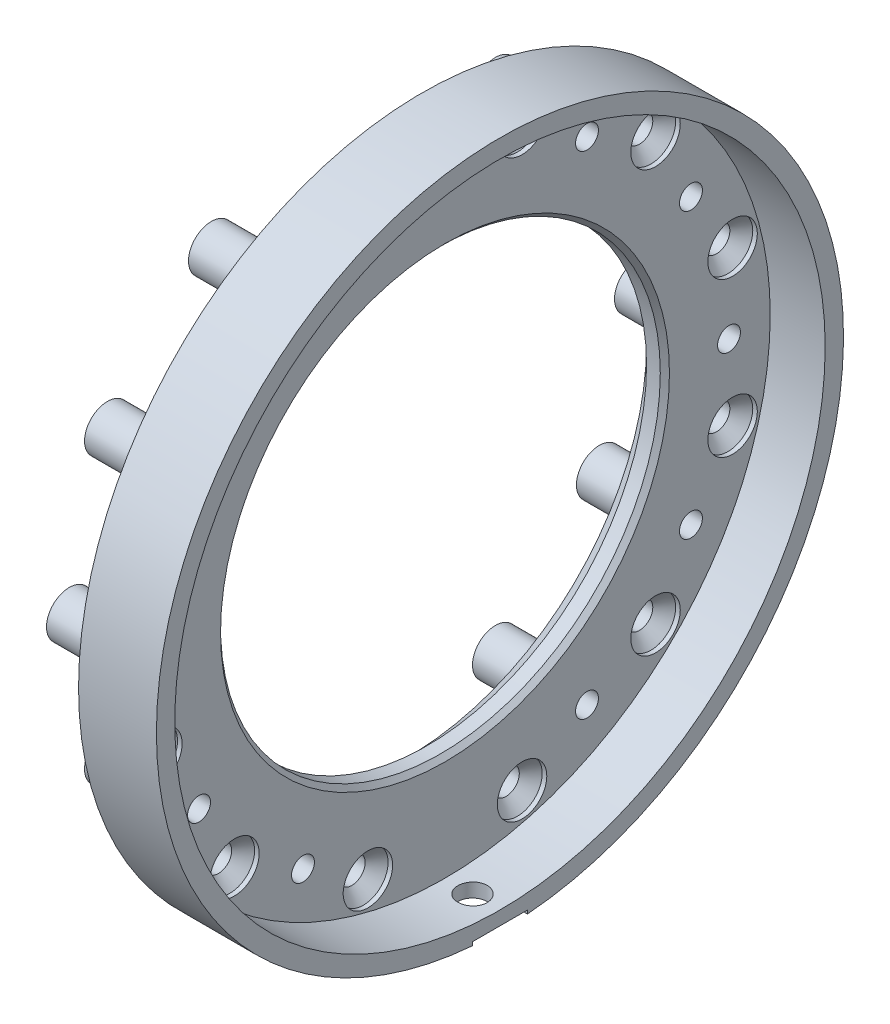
ISO-10303-21;
HEADER;
FILE_DESCRIPTION(('STEP AP214'),'2;1');
FILE_NAME('part.step','',(''),(''),'','','');
FILE_SCHEMA(('AUTOMOTIVE_DESIGN { 1 0 10303 214 1 1 1 1 }'));
ENDSEC;
DATA;
#1=APPLICATION_CONTEXT('core data for automotive mechanical design processes');
#2=APPLICATION_PROTOCOL_DEFINITION('international standard','automotive_design',2000,#1);
#3=PRODUCT_CONTEXT('',#1,'mechanical');
#4=PRODUCT('Part','Part','',(#3));
#5=PRODUCT_RELATED_PRODUCT_CATEGORY('part','',(#4));
#6=PRODUCT_DEFINITION_FORMATION('','',#4);
#7=PRODUCT_DEFINITION_CONTEXT('part definition',#1,'design');
#8=PRODUCT_DEFINITION('design','',#6,#7);
#9=PRODUCT_DEFINITION_SHAPE('','',#8);
#10=(LENGTH_UNIT() NAMED_UNIT(*) SI_UNIT(.MILLI.,.METRE.));
#11=(NAMED_UNIT(*) PLANE_ANGLE_UNIT() SI_UNIT($,.RADIAN.));
#12=(NAMED_UNIT(*) SI_UNIT($,.STERADIAN.) SOLID_ANGLE_UNIT());
#13=UNCERTAINTY_MEASURE_WITH_UNIT(LENGTH_MEASURE(1.E-05),#10,'distance_accuracy_value','');
#14=(GEOMETRIC_REPRESENTATION_CONTEXT(3) GLOBAL_UNCERTAINTY_ASSIGNED_CONTEXT((#13)) GLOBAL_UNIT_ASSIGNED_CONTEXT((#10,
#11,#12)) REPRESENTATION_CONTEXT('',''));
#15=CARTESIAN_POINT('',(0.,0.,0.));
#16=DIRECTION('',(0.,0.,1.));
#17=DIRECTION('',(1.,0.,0.));
#18=AXIS2_PLACEMENT_3D('',#15,#16,#17);
#19=CARTESIAN_POINT('',(36.5,0.,0.));
#20=DIRECTION('',(-1.,0.,0.));
#21=DIRECTION('',(0.,0.,1.));
#22=AXIS2_PLACEMENT_3D('',#19,#20,#21);
#23=CYLINDRICAL_SURFACE('',#22,37.5);
#24=CARTESIAN_POINT('',(36.5,0.,0.));
#25=DIRECTION('',(1.,0.,0.));
#26=DIRECTION('',(0.,0.,-1.));
#27=AXIS2_PLACEMENT_3D('',#24,#25,#26);
#28=CIRCLE('',#27,37.5);
#29=CARTESIAN_POINT('',(36.5,-37.3798073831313,-3.));
#30=VERTEX_POINT('',#29);
#31=CARTESIAN_POINT('',(36.5,-37.3798073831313,3.));
#32=VERTEX_POINT('',#31);
#33=EDGE_CURVE('E509',#30,#32,#28,.T.);
#34=ORIENTED_EDGE('',*,*,#33,.F.);
#35=DIRECTION('',(-1.,0.,0.));
#36=VECTOR('',#35,1.);
#37=CARTESIAN_POINT('',(36.5,-37.3798073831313,-3.));
#38=LINE('',#37,#36);
#39=CARTESIAN_POINT('',(33.5,-37.3798073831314,-3.));
#40=VERTEX_POINT('',#39);
#41=EDGE_CURVE('E311',#30,#40,#38,.T.);
#42=ORIENTED_EDGE('',*,*,#41,.T.);
#43=CARTESIAN_POINT('',(33.5,-37.3798073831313,-3.));
#44=CARTESIAN_POINT('',(33.4157657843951,-37.379804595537,-3.00000824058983));
#45=CARTESIAN_POINT('',(33.3315355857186,-37.3800920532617,-2.99645233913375));
#46=CARTESIAN_POINT('',(33.1636804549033,-37.3812268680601,-2.98227605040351));
#47=CARTESIAN_POINT('',(33.0800554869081,-37.3820741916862,-2.97165608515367));
#48=CARTESIAN_POINT('',(32.9140671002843,-37.3843072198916,-2.9434272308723));
#49=CARTESIAN_POINT('',(32.8317026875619,-37.3856924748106,-2.92582417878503));
#50=CARTESIAN_POINT('',(32.668774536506,-37.3889594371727,-2.88377403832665));
#51=CARTESIAN_POINT('',(32.5882107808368,-37.3908411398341,-2.85932701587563));
#52=CARTESIAN_POINT('',(32.3500080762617,-37.397157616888,-2.77592538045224));
#53=CARTESIAN_POINT('',(32.1957777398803,-37.4022649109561,-2.7068965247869));
#54=CARTESIAN_POINT('',(31.9012013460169,-37.4136928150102,-2.54405287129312));
#55=CARTESIAN_POINT('',(31.7608532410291,-37.4200132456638,-2.4502417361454));
#56=CARTESIAN_POINT('',(31.497570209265,-37.4331723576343,-2.24023851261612));
#57=CARTESIAN_POINT('',(31.3746709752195,-37.4400120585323,-2.12400166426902));
#58=CARTESIAN_POINT('',(31.150096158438,-37.4534303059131,-1.87253318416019));
#59=CARTESIAN_POINT('',(31.0484238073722,-37.4600088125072,-1.73729866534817));
#60=CARTESIAN_POINT('',(30.8690775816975,-37.4721724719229,-1.45146409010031));
#61=CARTESIAN_POINT('',(30.7914352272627,-37.4777563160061,-1.30084419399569));
#62=CARTESIAN_POINT('',(30.6625611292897,-37.4872899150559,-0.988663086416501));
#63=CARTESIAN_POINT('',(30.6113273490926,-37.491239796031,-0.827102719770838));
#64=CARTESIAN_POINT('',(30.5368231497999,-37.4970535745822,-0.497985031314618));
#65=CARTESIAN_POINT('',(30.5134931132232,-37.4989219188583,-0.330441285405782));
#66=CARTESIAN_POINT('',(30.4952744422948,-37.5003771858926,0.00619786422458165));
#67=CARTESIAN_POINT('',(30.5003860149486,-37.4999640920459,0.17529327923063));
#68=CARTESIAN_POINT('',(30.53885759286,-37.4969066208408,0.509822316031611));
#69=CARTESIAN_POINT('',(30.5721526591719,-37.4942673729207,0.675263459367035));
#70=CARTESIAN_POINT('',(30.6659450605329,-37.487060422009,0.998200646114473));
#71=CARTESIAN_POINT('',(30.7264425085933,-37.4824927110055,1.15569665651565));
#72=CARTESIAN_POINT('',(30.8729962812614,-37.4719338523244,1.45848364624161));
#73=CARTESIAN_POINT('',(30.9590822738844,-37.4659410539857,1.60376020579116));
#74=CARTESIAN_POINT('',(31.1543439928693,-37.4532060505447,1.87781948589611));
#75=CARTESIAN_POINT('',(31.2635190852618,-37.4464638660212,2.00660265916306));
#76=CARTESIAN_POINT('',(31.5022083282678,-37.4329663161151,2.24438968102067));
#77=CARTESIAN_POINT('',(31.6317760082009,-37.4262109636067,2.35333979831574));
#78=CARTESIAN_POINT('',(31.9074415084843,-37.4134644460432,2.54798498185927));
#79=CARTESIAN_POINT('',(32.0535444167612,-37.4074735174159,2.6336728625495));
#80=CARTESIAN_POINT('',(32.3581891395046,-37.3969322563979,2.77935557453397));
#81=CARTESIAN_POINT('',(32.5167396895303,-37.3923829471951,2.83933216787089));
#82=CARTESIAN_POINT('',(32.8415848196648,-37.3852547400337,2.93170775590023));
#83=CARTESIAN_POINT('',(33.0078672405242,-37.3826728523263,2.96414860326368));
#84=CARTESIAN_POINT('',(33.2294104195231,-37.3807473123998,2.98826740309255));
#85=CARTESIAN_POINT('',(33.283481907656,-37.3803950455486,2.99266936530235));
#86=CARTESIAN_POINT('',(33.3916948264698,-37.3799253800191,2.99853167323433));
#87=CARTESIAN_POINT('',(33.4458359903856,-37.3798075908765,2.99999690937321));
#88=CARTESIAN_POINT('',(33.5,-37.3798073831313,3.));
#89=B_SPLINE_CURVE_WITH_KNOTS('',3,(#43,#44,#45,#46,#47,#48,#49,#50,#51,#52,#53,#54,#55,#56,#57,
#58,#59,#60,#61,#62,#63,#64,#65,#66,#67,#68,#69,#70,#71,#72,#73,#74,#75,#76,#77,#78,#79,#80,#81,
#82,#83,#84,#85,#86,#87,#88),.UNSPECIFIED.,.F.,.F.,(4,2,2,2,2,2,2,2,2,2,2,2,2,2,2,2,2,2,2,2,2,2,
4),(0.,0.252619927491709,0.505224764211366,0.757618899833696,1.0100106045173,1.51455372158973,
2.01902231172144,2.52450839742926,3.03007138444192,3.53629473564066,4.0424790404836,
4.5475799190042,5.05268447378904,5.55662835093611,6.06057432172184,6.56510687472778,
7.06962557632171,7.57549140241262,8.08151330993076,8.58789356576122,9.09350276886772,
9.25620034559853,9.4186267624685),.UNSPECIFIED.);
#90=CARTESIAN_POINT('',(33.5,-37.3798073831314,3.));
#91=VERTEX_POINT('',#90);
#92=EDGE_CURVE('E826',#40,#91,#89,.T.);
#93=ORIENTED_EDGE('',*,*,#92,.T.);
#94=DIRECTION('',(-1.,0.,0.));
#95=VECTOR('',#94,1.);
#96=CARTESIAN_POINT('',(36.5,-37.3798073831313,3.));
#97=LINE('',#96,#95);
#98=EDGE_CURVE('E271',#91,#32,#97,.F.);
#99=ORIENTED_EDGE('',*,*,#98,.T.);
#100=EDGE_LOOP('',(#34,#42,#93,#99));
#101=FACE_BOUND('',#100,.T.);
#102=CARTESIAN_POINT('',(28.,0.,0.));
#103=DIRECTION('',(-1.,0.,0.));
#104=DIRECTION('',(0.,0.,1.));
#105=AXIS2_PLACEMENT_3D('',#102,#103,#104);
#106=CIRCLE('',#105,37.5);
#107=CARTESIAN_POINT('',(28.,0.,37.5));
#108=VERTEX_POINT('',#107);
#109=EDGE_CURVE('E503',#108,#108,#106,.T.);
#110=ORIENTED_EDGE('',*,*,#109,.F.);
#111=EDGE_LOOP('',(#110));
#112=FACE_BOUND('',#111,.T.);
#113=ADVANCED_FACE('F111',(#101,#112),#23,.T.);
#114=CARTESIAN_POINT('',(26.5,0.,0.));
#115=DIRECTION('',(1.,0.,0.));
#116=DIRECTION('',(0.,0.,-1.));
#117=AXIS2_PLACEMENT_3D('',#114,#115,#116);
#118=PLANE('',#117);
#119=CARTESIAN_POINT('',(26.5,0.,0.));
#120=DIRECTION('',(1.,0.,0.));
#121=DIRECTION('',(0.,0.,-1.));
#122=AXIS2_PLACEMENT_3D('',#119,#120,#121);
#123=CIRCLE('',#122,26.);
#124=CARTESIAN_POINT('',(26.5,0.,-26.));
#125=VERTEX_POINT('',#124);
#126=EDGE_CURVE('E801',#125,#125,#123,.T.);
#127=ORIENTED_EDGE('',*,*,#126,.T.);
#128=EDGE_LOOP('',(#127));
#129=FACE_BOUND('',#128,.T.);
#130=CARTESIAN_POINT('',(26.5,22.9809703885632,22.9809703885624));
#131=DIRECTION('',(1.,0.,0.));
#132=DIRECTION('',(0.,0.,-1.));
#133=AXIS2_PLACEMENT_3D('',#130,#131,#132);
#134=CIRCLE('',#133,1.45);
#135=CARTESIAN_POINT('',(26.5,22.9809703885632,21.5309703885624));
#136=VERTEX_POINT('',#135);
#137=EDGE_CURVE('E356',#136,#136,#134,.T.);
#138=ORIENTED_EDGE('',*,*,#137,.T.);
#139=EDGE_LOOP('',(#138));
#140=FACE_BOUND('',#139,.T.);
#141=CARTESIAN_POINT('',(26.5,8.41161896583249,31.3925893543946));
#142=DIRECTION('',(1.,0.,0.));
#143=DIRECTION('',(0.,0.,-1.));
#144=AXIS2_PLACEMENT_3D('',#141,#142,#143);
#145=CIRCLE('',#144,1.45);
#146=CARTESIAN_POINT('',(26.5,8.41161896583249,29.9425893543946));
#147=VERTEX_POINT('',#146);
#148=EDGE_CURVE('E368',#147,#147,#145,.T.);
#149=ORIENTED_EDGE('',*,*,#148,.T.);
#150=EDGE_LOOP('',(#149));
#151=FACE_BOUND('',#150,.T.);
#152=CARTESIAN_POINT('',(26.5,-8.41161896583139,31.3925893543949));
#153=DIRECTION('',(1.,0.,0.));
#154=DIRECTION('',(0.,0.,-1.));
#155=AXIS2_PLACEMENT_3D('',#152,#153,#154);
#156=CIRCLE('',#155,1.45);
#157=CARTESIAN_POINT('',(26.5,-8.41161896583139,29.9425893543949));
#158=VERTEX_POINT('',#157);
#159=EDGE_CURVE('E381',#158,#158,#156,.T.);
#160=ORIENTED_EDGE('',*,*,#159,.T.);
#161=EDGE_LOOP('',(#160));
#162=FACE_BOUND('',#161,.T.);
#163=CARTESIAN_POINT('',(26.5,-22.9809703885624,22.9809703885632));
#164=DIRECTION('',(1.,0.,0.));
#165=DIRECTION('',(0.,0.,-1.));
#166=AXIS2_PLACEMENT_3D('',#163,#164,#165);
#167=CIRCLE('',#166,1.45);
#168=CARTESIAN_POINT('',(26.5,-22.9809703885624,21.5309703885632));
#169=VERTEX_POINT('',#168);
#170=EDGE_CURVE('E394',#169,#169,#167,.T.);
#171=ORIENTED_EDGE('',*,*,#170,.T.);
#172=EDGE_LOOP('',(#171));
#173=FACE_BOUND('',#172,.T.);
#174=CARTESIAN_POINT('',(26.5,-31.3925893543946,8.41161896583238));
#175=DIRECTION('',(1.,0.,0.));
#176=DIRECTION('',(0.,0.,-1.));
#177=AXIS2_PLACEMENT_3D('',#174,#175,#176);
#178=CIRCLE('',#177,1.45);
#179=CARTESIAN_POINT('',(26.5,-31.3925893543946,6.96161896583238));
#180=VERTEX_POINT('',#179);
#181=EDGE_CURVE('E407',#180,#180,#178,.T.);
#182=ORIENTED_EDGE('',*,*,#181,.T.);
#183=EDGE_LOOP('',(#182));
#184=FACE_BOUND('',#183,.T.);
#185=CARTESIAN_POINT('',(26.5,-31.3925893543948,-8.41161896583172));
#186=DIRECTION('',(1.,0.,0.));
#187=DIRECTION('',(0.,0.,-1.));
#188=AXIS2_PLACEMENT_3D('',#185,#186,#187);
#189=CIRCLE('',#188,1.45);
#190=CARTESIAN_POINT('',(26.5,-31.3925893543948,-9.86161896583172));
#191=VERTEX_POINT('',#190);
#192=EDGE_CURVE('E420',#191,#191,#189,.T.);
#193=ORIENTED_EDGE('',*,*,#192,.T.);
#194=EDGE_LOOP('',(#193));
#195=FACE_BOUND('',#194,.T.);
#196=CARTESIAN_POINT('',(26.5,-22.9809703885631,-22.9809703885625));
#197=DIRECTION('',(1.,0.,0.));
#198=DIRECTION('',(0.,0.,-1.));
#199=AXIS2_PLACEMENT_3D('',#196,#197,#198);
#200=CIRCLE('',#199,1.45);
#201=CARTESIAN_POINT('',(26.5,-22.9809703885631,-24.4309703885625));
#202=VERTEX_POINT('',#201);
#203=EDGE_CURVE('E433',#202,#202,#200,.T.);
#204=ORIENTED_EDGE('',*,*,#203,.T.);
#205=EDGE_LOOP('',(#204));
#206=FACE_BOUND('',#205,.T.);
#207=CARTESIAN_POINT('',(26.5,-8.41161896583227,-31.3925893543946));
#208=DIRECTION('',(1.,0.,0.));
#209=DIRECTION('',(0.,0.,-1.));
#210=AXIS2_PLACEMENT_3D('',#207,#208,#209);
#211=CIRCLE('',#210,1.45);
#212=CARTESIAN_POINT('',(26.5,-8.41161896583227,-32.8425893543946));
#213=VERTEX_POINT('',#212);
#214=EDGE_CURVE('E446',#213,#213,#211,.T.);
#215=ORIENTED_EDGE('',*,*,#214,.T.);
#216=EDGE_LOOP('',(#215));
#217=FACE_BOUND('',#216,.T.);
#218=CARTESIAN_POINT('',(26.5,8.41161896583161,-31.3925893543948));
#219=DIRECTION('',(1.,0.,0.));
#220=DIRECTION('',(0.,0.,-1.));
#221=AXIS2_PLACEMENT_3D('',#218,#219,#220);
#222=CIRCLE('',#221,1.45);
#223=CARTESIAN_POINT('',(26.5,8.41161896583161,-32.8425893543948));
#224=VERTEX_POINT('',#223);
#225=EDGE_CURVE('E459',#224,#224,#222,.T.);
#226=ORIENTED_EDGE('',*,*,#225,.T.);
#227=EDGE_LOOP('',(#226));
#228=FACE_BOUND('',#227,.T.);
#229=CARTESIAN_POINT('',(26.5,22.9809703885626,-22.980970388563));
#230=DIRECTION('',(1.,0.,0.));
#231=DIRECTION('',(0.,0.,-1.));
#232=AXIS2_PLACEMENT_3D('',#229,#230,#231);
#233=CIRCLE('',#232,1.45);
#234=CARTESIAN_POINT('',(26.5,22.9809703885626,-24.430970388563));
#235=VERTEX_POINT('',#234);
#236=EDGE_CURVE('E472',#235,#235,#233,.T.);
#237=ORIENTED_EDGE('',*,*,#236,.T.);
#238=EDGE_LOOP('',(#237));
#239=FACE_BOUND('',#238,.T.);
#240=CARTESIAN_POINT('',(26.5,31.3925893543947,-8.41161896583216));
#241=DIRECTION('',(1.,0.,0.));
#242=DIRECTION('',(0.,0.,-1.));
#243=AXIS2_PLACEMENT_3D('',#240,#241,#242);
#244=CIRCLE('',#243,1.45);
#245=CARTESIAN_POINT('',(26.5,31.3925893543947,-9.86161896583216));
#246=VERTEX_POINT('',#245);
#247=EDGE_CURVE('E485',#246,#246,#244,.T.);
#248=ORIENTED_EDGE('',*,*,#247,.T.);
#249=EDGE_LOOP('',(#248));
#250=FACE_BOUND('',#249,.T.);
#251=CARTESIAN_POINT('',(26.5,31.3925893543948,8.41161896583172));
#252=DIRECTION('',(1.,0.,0.));
#253=DIRECTION('',(0.,0.,-1.));
#254=AXIS2_PLACEMENT_3D('',#251,#252,#253);
#255=CIRCLE('',#254,1.45);
#256=CARTESIAN_POINT('',(26.5,31.3925893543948,6.96161896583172));
#257=VERTEX_POINT('',#256);
#258=EDGE_CURVE('E498',#257,#257,#255,.T.);
#259=ORIENTED_EDGE('',*,*,#258,.T.);
#260=EDGE_LOOP('',(#259));
#261=FACE_BOUND('',#260,.T.);
#262=CARTESIAN_POINT('',(26.5,0.,31.));
#263=DIRECTION('',(1.,0.,0.));
#264=DIRECTION('',(0.,0.,-1.));
#265=AXIS2_PLACEMENT_3D('',#262,#263,#264);
#266=CIRCLE('',#265,2.5);
#267=CARTESIAN_POINT('',(26.5,0.,28.5));
#268=VERTEX_POINT('',#267);
#269=EDGE_CURVE('E540',#268,#268,#266,.T.);
#270=ORIENTED_EDGE('',*,*,#269,.T.);
#271=EDGE_LOOP('',(#270));
#272=FACE_BOUND('',#271,.T.);
#273=CARTESIAN_POINT('',(26.5,15.5,26.8467875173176));
#274=DIRECTION('',(1.,0.,0.));
#275=DIRECTION('',(0.,0.,-1.));
#276=AXIS2_PLACEMENT_3D('',#273,#274,#275);
#277=CIRCLE('',#276,2.5);
#278=CARTESIAN_POINT('',(26.5,15.5,24.3467875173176));
#279=VERTEX_POINT('',#278);
#280=EDGE_CURVE('E536',#279,#279,#277,.T.);
#281=ORIENTED_EDGE('',*,*,#280,.T.);
#282=EDGE_LOOP('',(#281));
#283=FACE_BOUND('',#282,.T.);
#284=CARTESIAN_POINT('',(26.5,26.8467875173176,15.4999999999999));
#285=DIRECTION('',(1.,0.,0.));
#286=DIRECTION('',(0.,0.,-1.));
#287=AXIS2_PLACEMENT_3D('',#284,#285,#286);
#288=CIRCLE('',#287,2.5);
#289=CARTESIAN_POINT('',(26.5,26.8467875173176,12.9999999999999));
#290=VERTEX_POINT('',#289);
#291=EDGE_CURVE('E532',#290,#290,#288,.T.);
#292=ORIENTED_EDGE('',*,*,#291,.T.);
#293=EDGE_LOOP('',(#292));
#294=FACE_BOUND('',#293,.T.);
#295=CARTESIAN_POINT('',(26.5,26.8467875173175,-15.5000000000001));
#296=DIRECTION('',(1.,0.,0.));
#297=DIRECTION('',(0.,0.,-1.));
#298=AXIS2_PLACEMENT_3D('',#295,#296,#297);
#299=CIRCLE('',#298,2.5);
#300=CARTESIAN_POINT('',(26.5,26.8467875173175,-18.0000000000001));
#301=VERTEX_POINT('',#300);
#302=EDGE_CURVE('E528',#301,#301,#299,.T.);
#303=ORIENTED_EDGE('',*,*,#302,.T.);
#304=EDGE_LOOP('',(#303));
#305=FACE_BOUND('',#304,.T.);
#306=CARTESIAN_POINT('',(26.5,15.4999999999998,-26.8467875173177));
#307=DIRECTION('',(1.,0.,0.));
#308=DIRECTION('',(0.,0.,-1.));
#309=AXIS2_PLACEMENT_3D('',#306,#307,#308);
#310=CIRCLE('',#309,2.5);
#311=CARTESIAN_POINT('',(26.5,15.4999999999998,-29.3467875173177));
#312=VERTEX_POINT('',#311);
#313=EDGE_CURVE('E525',#312,#312,#310,.T.);
#314=ORIENTED_EDGE('',*,*,#313,.T.);
#315=EDGE_LOOP('',(#314));
#316=FACE_BOUND('',#315,.T.);
#317=CARTESIAN_POINT('',(26.5,-2.15105711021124E-13,-31.));
#318=DIRECTION('',(1.,0.,0.));
#319=DIRECTION('',(0.,0.,-1.));
#320=AXIS2_PLACEMENT_3D('',#317,#318,#319);
#321=CIRCLE('',#320,2.49999999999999);
#322=CARTESIAN_POINT('',(26.5,-2.15105711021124E-13,-33.5));
#323=VERTEX_POINT('',#322);
#324=EDGE_CURVE('E521',#323,#323,#321,.T.);
#325=ORIENTED_EDGE('',*,*,#324,.T.);
#326=EDGE_LOOP('',(#325));
#327=FACE_BOUND('',#326,.T.);
#328=CARTESIAN_POINT('',(26.5,-15.5000000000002,-26.8467875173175));
#329=DIRECTION('',(1.,0.,0.));
#330=DIRECTION('',(0.,0.,-1.));
#331=AXIS2_PLACEMENT_3D('',#328,#329,#330);
#332=CIRCLE('',#331,2.5);
#333=CARTESIAN_POINT('',(26.5,-15.5000000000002,-29.3467875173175));
#334=VERTEX_POINT('',#333);
#335=EDGE_CURVE('E517',#334,#334,#332,.T.);
#336=ORIENTED_EDGE('',*,*,#335,.T.);
#337=EDGE_LOOP('',(#336));
#338=FACE_BOUND('',#337,.T.);
#339=CARTESIAN_POINT('',(26.5,-26.8467875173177,-15.4999999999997));
#340=DIRECTION('',(1.,0.,0.));
#341=DIRECTION('',(0.,0.,-1.));
#342=AXIS2_PLACEMENT_3D('',#339,#340,#341);
#343=CIRCLE('',#342,2.5);
#344=CARTESIAN_POINT('',(26.5,-26.8467875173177,-17.9999999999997));
#345=VERTEX_POINT('',#344);
#346=EDGE_CURVE('E513',#345,#345,#343,.T.);
#347=ORIENTED_EDGE('',*,*,#346,.T.);
#348=EDGE_LOOP('',(#347));
#349=FACE_BOUND('',#348,.T.);
#350=CARTESIAN_POINT('',(26.5,-26.8467875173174,15.5000000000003));
#351=DIRECTION('',(1.,0.,0.));
#352=DIRECTION('',(0.,0.,-1.));
#353=AXIS2_PLACEMENT_3D('',#350,#351,#352);
#354=CIRCLE('',#353,2.50000000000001);
#355=CARTESIAN_POINT('',(26.5,-26.8467875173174,13.0000000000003));
#356=VERTEX_POINT('',#355);
#357=EDGE_CURVE('E508',#356,#356,#354,.T.);
#358=ORIENTED_EDGE('',*,*,#357,.T.);
#359=EDGE_LOOP('',(#358));
#360=FACE_BOUND('',#359,.T.);
#361=CARTESIAN_POINT('',(26.5,-15.4999999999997,26.8467875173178));
#362=DIRECTION('',(1.,0.,0.));
#363=DIRECTION('',(0.,0.,-1.));
#364=AXIS2_PLACEMENT_3D('',#361,#362,#363);
#365=CIRCLE('',#364,2.5);
#366=CARTESIAN_POINT('',(26.5,-15.4999999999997,24.3467875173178));
#367=VERTEX_POINT('',#366);
#368=EDGE_CURVE('E504',#367,#367,#365,.T.);
#369=ORIENTED_EDGE('',*,*,#368,.T.);
#370=EDGE_LOOP('',(#369));
#371=FACE_BOUND('',#370,.T.);
#372=DIRECTION('',(0.,-0.666146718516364,0.745820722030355));
#373=VECTOR('',#372,1.);
#374=CARTESIAN_POINT('',(26.5,33.547432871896,-2.));
#375=LINE('',#374,#373);
#376=CARTESIAN_POINT('',(26.5,33.547432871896,-2.));
#377=VERTEX_POINT('',#376);
#378=CARTESIAN_POINT('',(26.5,34.8308431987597,-3.43691170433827));
#379=VERTEX_POINT('',#378);
#380=EDGE_CURVE('E784',#377,#379,#375,.F.);
#381=ORIENTED_EDGE('',*,*,#380,.T.);
#382=CARTESIAN_POINT('',(26.5,0.,0.));
#383=DIRECTION('',(1.,0.,0.));
#384=DIRECTION('',(0.,0.,-1.));
#385=AXIS2_PLACEMENT_3D('',#382,#383,#384);
#386=CIRCLE('',#385,35.);
#387=CARTESIAN_POINT('',(26.5,34.8308431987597,3.43691170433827));
#388=VERTEX_POINT('',#387);
#389=EDGE_CURVE('E834',#379,#388,#386,.F.);
#390=ORIENTED_EDGE('',*,*,#389,.T.);
#391=DIRECTION('',(0.,-0.666146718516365,-0.745820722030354));
#392=VECTOR('',#391,1.);
#393=CARTESIAN_POINT('',(26.5,33.547432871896,2.));
#394=LINE('',#393,#392);
#395=CARTESIAN_POINT('',(26.5,33.547432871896,2.));
#396=VERTEX_POINT('',#395);
#397=EDGE_CURVE('E788',#388,#396,#394,.T.);
#398=ORIENTED_EDGE('',*,*,#397,.T.);
#399=DIRECTION('',(0.,1.,0.));
#400=VECTOR('',#399,1.);
#401=CARTESIAN_POINT('',(26.5,41.,2.));
#402=LINE('',#401,#400);
#403=CARTESIAN_POINT('',(26.5,31.,2.));
#404=VERTEX_POINT('',#403);
#405=EDGE_CURVE('E320',#404,#396,#402,.T.);
#406=ORIENTED_EDGE('',*,*,#405,.F.);
#407=CARTESIAN_POINT('',(26.5,31.,0.));
#408=DIRECTION('',(-1.,0.,0.));
#409=DIRECTION('',(0.,0.,1.));
#410=AXIS2_PLACEMENT_3D('',#407,#408,#409);
#411=CIRCLE('',#410,2.);
#412=CARTESIAN_POINT('',(26.5,31.,-2.));
#413=VERTEX_POINT('',#412);
#414=EDGE_CURVE('E331',#413,#404,#411,.T.);
#415=ORIENTED_EDGE('',*,*,#414,.F.);
#416=DIRECTION('',(0.,-1.,0.));
#417=VECTOR('',#416,1.);
#418=CARTESIAN_POINT('',(26.5,41.,-2.));
#419=LINE('',#418,#417);
#420=EDGE_CURVE('E315',#377,#413,#419,.T.);
#421=ORIENTED_EDGE('',*,*,#420,.F.);
#422=EDGE_LOOP('',(#381,#390,#398,#406,#415,#421));
#423=FACE_BOUND('',#422,.T.);
#424=ADVANCED_FACE('F1027',(#129,#140,#151,#162,#173,#184,#195,#206,#217,#228,#239,#250,#261,
#272,#283,#294,#305,#316,#327,#338,#349,#360,#371,#423),#118,.F.);
#425=CARTESIAN_POINT('',(-93.9091629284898,0.,0.));
#426=DIRECTION('',(1.,0.,0.));
#427=DIRECTION('',(0.,0.,-1.));
#428=AXIS2_PLACEMENT_3D('',#425,#426,#427);
#429=CYLINDRICAL_SURFACE('',#428,35.5);
#430=CARTESIAN_POINT('',(33.5,-35.4639253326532,-1.6));
#431=CARTESIAN_POINT('',(33.5898237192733,-35.463925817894,-1.59999603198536));
#432=CARTESIAN_POINT('',(33.6797114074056,-35.4642702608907,-1.59241056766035));
#433=CARTESIAN_POINT('',(33.8570078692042,-35.4656110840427,-1.56225779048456));
#434=CARTESIAN_POINT('',(33.9444135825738,-35.4666082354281,-1.53967275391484));
#435=CARTESIAN_POINT('',(34.1141520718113,-35.4691412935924,-1.48016809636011));
#436=CARTESIAN_POINT('',(34.1964873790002,-35.470676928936,-1.44325569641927));
#437=CARTESIAN_POINT('',(34.3537705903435,-35.4741135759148,-1.35615499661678));
#438=CARTESIAN_POINT('',(34.4287202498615,-35.4760145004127,-1.30596986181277));
#439=CARTESIAN_POINT('',(34.5691908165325,-35.4799693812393,-1.19370039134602));
#440=CARTESIAN_POINT('',(34.6347047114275,-35.4820234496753,-1.13160728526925));
#441=CARTESIAN_POINT('',(34.754384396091,-35.4860520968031,-0.997301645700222));
#442=CARTESIAN_POINT('',(34.8085497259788,-35.488026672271,-0.925088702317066));
#443=CARTESIAN_POINT('',(34.9040126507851,-35.4916746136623,-0.772558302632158));
#444=CARTESIAN_POINT('',(34.9453049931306,-35.4933478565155,-0.692237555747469));
#445=CARTESIAN_POINT('',(35.0138160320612,-35.4962034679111,-0.525794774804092));
#446=CARTESIAN_POINT('',(35.0410348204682,-35.4973858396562,-0.43967277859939));
#447=CARTESIAN_POINT('',(35.080608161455,-35.4991257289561,-0.264134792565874));
#448=CARTESIAN_POINT('',(35.0929728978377,-35.4996836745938,-0.174721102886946));
#449=CARTESIAN_POINT('',(35.1025185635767,-35.5001132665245,0.00491438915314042));
#450=CARTESIAN_POINT('',(35.0996995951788,-35.4999849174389,0.09513618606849));
#451=CARTESIAN_POINT('',(35.0789663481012,-35.4990567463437,0.27375787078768));
#452=CARTESIAN_POINT('',(35.0610630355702,-35.4982574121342,0.36215903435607));
#453=CARTESIAN_POINT('',(35.0106863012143,-35.4960778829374,0.534699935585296));
#454=CARTESIAN_POINT('',(34.9782128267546,-35.4946976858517,0.618839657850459));
#455=CARTESIAN_POINT('',(34.8996050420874,-35.4915110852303,0.780504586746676));
#456=CARTESIAN_POINT('',(34.8534657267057,-35.4897045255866,0.85802735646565));
#457=CARTESIAN_POINT('',(34.7488396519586,-35.4858686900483,1.00423114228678));
#458=CARTESIAN_POINT('',(34.6903528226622,-35.4838394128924,1.07291210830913));
#459=CARTESIAN_POINT('',(34.5626299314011,-35.4797845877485,1.19954662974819));
#460=CARTESIAN_POINT('',(34.4933843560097,-35.477759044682,1.25749059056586));
#461=CARTESIAN_POINT('',(34.3461430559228,-35.4739418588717,1.36093238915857));
#462=CARTESIAN_POINT('',(34.2681473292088,-35.4721502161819,1.40643022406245));
#463=CARTESIAN_POINT('',(34.1056140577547,-35.4690030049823,1.48368736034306));
#464=CARTESIAN_POINT('',(34.0210763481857,-35.4676474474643,1.51544631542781));
#465=CARTESIAN_POINT('',(33.8478613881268,-35.4655257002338,1.56431783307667));
#466=CARTESIAN_POINT('',(33.7591841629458,-35.4647595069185,1.58143048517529));
#467=CARTESIAN_POINT('',(33.5802909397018,-35.4639035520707,1.60051179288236));
#468=CARTESIAN_POINT('',(33.4900763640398,-35.4638131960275,1.60249375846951));
#469=CARTESIAN_POINT('',(33.3105958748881,-35.464317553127,1.59129215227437));
#470=CARTESIAN_POINT('',(33.2213299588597,-35.4649122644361,1.57810862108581));
#471=CARTESIAN_POINT('',(33.0463180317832,-35.4667191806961,1.53696128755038));
#472=CARTESIAN_POINT('',(32.9605705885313,-35.4679311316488,1.50900356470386));
#473=CARTESIAN_POINT('',(32.7949855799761,-35.4708357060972,1.43910761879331));
#474=CARTESIAN_POINT('',(32.7151480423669,-35.4725283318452,1.3971693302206));
#475=CARTESIAN_POINT('',(32.5635878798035,-35.4762049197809,1.30046852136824));
#476=CARTESIAN_POINT('',(32.4918709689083,-35.4781890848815,1.24569705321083));
#477=CARTESIAN_POINT('',(32.3586452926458,-35.4822243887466,1.12489773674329));
#478=CARTESIAN_POINT('',(32.297136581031,-35.4842755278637,1.05886982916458));
#479=CARTESIAN_POINT('',(32.186028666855,-35.4882153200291,0.917374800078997));
#480=CARTESIAN_POINT('',(32.1364380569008,-35.4901038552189,0.841900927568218));
#481=CARTESIAN_POINT('',(32.0506327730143,-35.4935039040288,0.683690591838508));
#482=CARTESIAN_POINT('',(32.0144180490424,-35.4950154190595,0.600954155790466));
#483=CARTESIAN_POINT('',(31.9564075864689,-35.4974905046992,0.430599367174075));
#484=CARTESIAN_POINT('',(31.9346063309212,-35.4984542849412,0.342982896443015));
#485=CARTESIAN_POINT('',(31.9060235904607,-35.4997261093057,0.165328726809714));
#486=CARTESIAN_POINT('',(31.8992420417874,-35.5000341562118,0.0752910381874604));
#487=CARTESIAN_POINT('',(31.9008918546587,-35.4999598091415,-0.104564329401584));
#488=CARTESIAN_POINT('',(31.9093097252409,-35.4995780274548,-0.194382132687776));
#489=CARTESIAN_POINT('',(31.9410915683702,-35.4981682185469,-0.371328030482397));
#490=CARTESIAN_POINT('',(31.9644555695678,-35.4971401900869,-0.458456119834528));
#491=CARTESIAN_POINT('',(32.0254638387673,-35.4945535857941,-0.627552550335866));
#492=CARTESIAN_POINT('',(32.0631082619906,-35.4929950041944,-0.709520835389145));
#493=CARTESIAN_POINT('',(32.1516061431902,-35.4895226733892,-0.865974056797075));
#494=CARTESIAN_POINT('',(32.202459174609,-35.4876089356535,-0.940459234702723));
#495=CARTESIAN_POINT('',(32.3159779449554,-35.4836398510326,-1.07989857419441));
#496=CARTESIAN_POINT('',(32.3786528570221,-35.4815843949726,-1.14484526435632));
#497=CARTESIAN_POINT('',(32.5140346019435,-35.4775641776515,-1.26331458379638));
#498=CARTESIAN_POINT('',(32.5867439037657,-35.4755994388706,-1.31683439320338));
#499=CARTESIAN_POINT('',(32.7401791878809,-35.4719811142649,-1.41095109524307));
#500=CARTESIAN_POINT('',(32.8209120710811,-35.4703277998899,-1.45153673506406));
#501=CARTESIAN_POINT('',(32.9879925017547,-35.467523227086,-1.51852920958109));
#502=CARTESIAN_POINT('',(33.0743332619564,-35.4663713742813,-1.54495283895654));
#503=CARTESIAN_POINT('',(33.2176776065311,-35.4650054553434,-1.57591922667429));
#504=CARTESIAN_POINT('',(33.2737521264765,-35.4646021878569,-1.58493803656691));
#505=CARTESIAN_POINT('',(33.3865425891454,-35.4640619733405,-1.59697967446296));
#506=CARTESIAN_POINT('',(33.4432585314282,-35.4639250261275,-1.60000250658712));
#507=CARTESIAN_POINT('',(33.5,-35.4639253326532,-1.6));
#508=B_SPLINE_CURVE_WITH_KNOTS('',3,(#430,#431,#432,#433,#434,#435,#436,#437,#438,#439,#440,
#441,#442,#443,#444,#445,#446,#447,#448,#449,#450,#451,#452,#453,#454,#455,#456,#457,#458,#459,
#460,#461,#462,#463,#464,#465,#466,#467,#468,#469,#470,#471,#472,#473,#474,#475,#476,#477,#478,
#479,#480,#481,#482,#483,#484,#485,#486,#487,#488,#489,#490,#491,#492,#493,#494,#495,#496,#497,
#498,#499,#500,#501,#502,#503,#504,#505,#506,#507),.UNSPECIFIED.,.T.,.F.,(4,2,2,2,2,2,2,2,2,2,2,
2,2,2,2,2,2,2,2,2,2,2,2,2,2,2,2,2,2,2,2,2,2,2,2,2,2,2,4),(0.,0.269264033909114,
0.538846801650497,0.808293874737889,1.07767675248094,1.34725880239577,1.61685177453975,
1.88655460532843,2.15625567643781,2.42577173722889,2.69528598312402,2.9646044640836,
3.23392391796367,3.50334213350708,3.77276187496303,4.04242122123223,4.31208062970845,
4.58174683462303,4.85141139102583,5.12083870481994,5.39026529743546,5.65958110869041,
5.92889818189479,6.19840359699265,6.46791043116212,6.73761099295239,7.00731054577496,
7.2769068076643,7.54650192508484,7.81585786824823,8.08521432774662,8.35457371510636,
8.62392440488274,8.89348496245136,9.16311196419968,9.43297290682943,9.70251311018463,
9.87260679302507,10.0427003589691),.UNSPECIFIED.);
#509=CARTESIAN_POINT('',(33.5,-35.4639253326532,-1.6));
#510=VERTEX_POINT('',#509);
#511=EDGE_CURVE('E291',#510,#510,#508,.T.);
#512=ORIENTED_EDGE('',*,*,#511,.T.);
#513=EDGE_LOOP('',(#512));
#514=FACE_BOUND('',#513,.T.);
#515=CARTESIAN_POINT('',(36.5,0.,0.));
#516=DIRECTION('',(1.,0.,0.));
#517=DIRECTION('',(0.,0.,-1.));
#518=AXIS2_PLACEMENT_3D('',#515,#516,#517);
#519=CIRCLE('',#518,35.5);
#520=CARTESIAN_POINT('',(36.5,0.,-35.5));
#521=VERTEX_POINT('',#520);
#522=EDGE_CURVE('E581',#521,#521,#519,.T.);
#523=ORIENTED_EDGE('',*,*,#522,.T.);
#524=EDGE_LOOP('',(#523));
#525=FACE_BOUND('',#524,.T.);
#526=CARTESIAN_POINT('',(31.5,0.,0.));
#527=DIRECTION('',(1.,0.,0.));
#528=DIRECTION('',(0.,0.,-1.));
#529=AXIS2_PLACEMENT_3D('',#526,#527,#528);
#530=CIRCLE('',#529,35.5);
#531=CARTESIAN_POINT('',(31.5,35.3114043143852,3.65441176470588));
#532=VERTEX_POINT('',#531);
#533=CARTESIAN_POINT('',(31.5,35.3114043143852,-3.65441176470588));
#534=VERTEX_POINT('',#533);
#535=EDGE_CURVE('E570',#532,#534,#530,.F.);
#536=ORIENTED_EDGE('',*,*,#535,.T.);
#537=DIRECTION('',(1.,0.,0.));
#538=VECTOR('',#537,1.);
#539=CARTESIAN_POINT('',(-93.9091629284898,35.3114043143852,-3.65441176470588));
#540=LINE('',#539,#538);
#541=CARTESIAN_POINT('',(30.5,35.3114043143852,-3.65441176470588));
#542=VERTEX_POINT('',#541);
#543=EDGE_CURVE('E566',#534,#542,#540,.F.);
#544=ORIENTED_EDGE('',*,*,#543,.T.);
#545=CARTESIAN_POINT('',(30.5,0.,0.));
#546=DIRECTION('',(1.,0.,0.));
#547=DIRECTION('',(0.,0.,-1.));
#548=AXIS2_PLACEMENT_3D('',#545,#546,#547);
#549=CIRCLE('',#548,35.5);
#550=CARTESIAN_POINT('',(30.5,35.3114043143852,3.65441176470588));
#551=VERTEX_POINT('',#550);
#552=EDGE_CURVE('E562',#551,#542,#549,.T.);
#553=ORIENTED_EDGE('',*,*,#552,.F.);
#554=DIRECTION('',(1.,0.,0.));
#555=VECTOR('',#554,1.);
#556=CARTESIAN_POINT('',(-93.9091629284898,35.3114043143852,3.65441176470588));
#557=LINE('',#556,#555);
#558=EDGE_CURVE('E569',#551,#532,#557,.T.);
#559=ORIENTED_EDGE('',*,*,#558,.T.);
#560=EDGE_LOOP('',(#536,#544,#553,#559));
#561=FACE_BOUND('',#560,.T.);
#562=ADVANCED_FACE('F1032',(#514,#525,#561),#429,.F.);
#563=CARTESIAN_POINT('',(30.5,0.,0.));
#564=DIRECTION('',(1.,0.,0.));
#565=DIRECTION('',(0.,0.,-1.));
#566=AXIS2_PLACEMENT_3D('',#563,#564,#565);
#567=PLANE('',#566);
#568=CARTESIAN_POINT('',(30.5,0.,0.));
#569=DIRECTION('',(1.,0.,0.));
#570=DIRECTION('',(0.,0.,-1.));
#571=AXIS2_PLACEMENT_3D('',#568,#569,#570);
#572=CIRCLE('',#571,24.5000000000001);
#573=CARTESIAN_POINT('',(30.5,0.,-24.5000000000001));
#574=VERTEX_POINT('',#573);
#575=EDGE_CURVE('E813',#574,#574,#572,.F.);
#576=ORIENTED_EDGE('',*,*,#575,.T.);
#577=EDGE_LOOP('',(#576));
#578=FACE_BOUND('',#577,.T.);
#579=CARTESIAN_POINT('',(30.5,22.9809703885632,22.9809703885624));
#580=DIRECTION('',(1.,0.,0.));
#581=DIRECTION('',(0.,0.,-1.));
#582=AXIS2_PLACEMENT_3D('',#579,#580,#581);
#583=CIRCLE('',#582,2.7);
#584=CARTESIAN_POINT('',(30.5,22.9809703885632,20.2809703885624));
#585=VERTEX_POINT('',#584);
#586=EDGE_CURVE('E341',#585,#585,#583,.T.);
#587=ORIENTED_EDGE('',*,*,#586,.F.);
#588=EDGE_LOOP('',(#587));
#589=FACE_BOUND('',#588,.T.);
#590=CARTESIAN_POINT('',(30.5,8.41161896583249,31.3925893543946));
#591=DIRECTION('',(1.,0.,0.));
#592=DIRECTION('',(0.,0.,-1.));
#593=AXIS2_PLACEMENT_3D('',#590,#591,#592);
#594=CIRCLE('',#593,2.7);
#595=CARTESIAN_POINT('',(30.5,8.41161896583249,28.6925893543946));
#596=VERTEX_POINT('',#595);
#597=EDGE_CURVE('E357',#596,#596,#594,.T.);
#598=ORIENTED_EDGE('',*,*,#597,.F.);
#599=EDGE_LOOP('',(#598));
#600=FACE_BOUND('',#599,.T.);
#601=CARTESIAN_POINT('',(30.5,-8.41161896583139,31.3925893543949));
#602=DIRECTION('',(1.,0.,0.));
#603=DIRECTION('',(0.,0.,-1.));
#604=AXIS2_PLACEMENT_3D('',#601,#602,#603);
#605=CIRCLE('',#604,2.7);
#606=CARTESIAN_POINT('',(30.5,-8.41161896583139,28.6925893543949));
#607=VERTEX_POINT('',#606);
#608=EDGE_CURVE('E369',#607,#607,#605,.T.);
#609=ORIENTED_EDGE('',*,*,#608,.F.);
#610=EDGE_LOOP('',(#609));
#611=FACE_BOUND('',#610,.T.);
#612=CARTESIAN_POINT('',(30.5,-22.9809703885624,22.9809703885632));
#613=DIRECTION('',(1.,0.,0.));
#614=DIRECTION('',(0.,0.,-1.));
#615=AXIS2_PLACEMENT_3D('',#612,#613,#614);
#616=CIRCLE('',#615,2.7);
#617=CARTESIAN_POINT('',(30.5,-22.9809703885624,20.2809703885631));
#618=VERTEX_POINT('',#617);
#619=EDGE_CURVE('E382',#618,#618,#616,.T.);
#620=ORIENTED_EDGE('',*,*,#619,.F.);
#621=EDGE_LOOP('',(#620));
#622=FACE_BOUND('',#621,.T.);
#623=CARTESIAN_POINT('',(30.5,-31.3925893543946,8.41161896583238));
#624=DIRECTION('',(1.,0.,0.));
#625=DIRECTION('',(0.,0.,-1.));
#626=AXIS2_PLACEMENT_3D('',#623,#624,#625);
#627=CIRCLE('',#626,2.7);
#628=CARTESIAN_POINT('',(30.5,-31.3925893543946,5.71161896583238));
#629=VERTEX_POINT('',#628);
#630=EDGE_CURVE('E395',#629,#629,#627,.T.);
#631=ORIENTED_EDGE('',*,*,#630,.F.);
#632=EDGE_LOOP('',(#631));
#633=FACE_BOUND('',#632,.T.);
#634=CARTESIAN_POINT('',(30.5,-31.3925893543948,-8.41161896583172));
#635=DIRECTION('',(1.,0.,0.));
#636=DIRECTION('',(0.,0.,-1.));
#637=AXIS2_PLACEMENT_3D('',#634,#635,#636);
#638=CIRCLE('',#637,2.7);
#639=CARTESIAN_POINT('',(30.5,-31.3925893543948,-11.1116189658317));
#640=VERTEX_POINT('',#639);
#641=EDGE_CURVE('E408',#640,#640,#638,.T.);
#642=ORIENTED_EDGE('',*,*,#641,.F.);
#643=EDGE_LOOP('',(#642));
#644=FACE_BOUND('',#643,.T.);
#645=CARTESIAN_POINT('',(30.5,-22.9809703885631,-22.9809703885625));
#646=DIRECTION('',(1.,0.,0.));
#647=DIRECTION('',(0.,0.,-1.));
#648=AXIS2_PLACEMENT_3D('',#645,#646,#647);
#649=CIRCLE('',#648,2.7);
#650=CARTESIAN_POINT('',(30.5,-22.9809703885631,-25.6809703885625));
#651=VERTEX_POINT('',#650);
#652=EDGE_CURVE('E421',#651,#651,#649,.T.);
#653=ORIENTED_EDGE('',*,*,#652,.F.);
#654=EDGE_LOOP('',(#653));
#655=FACE_BOUND('',#654,.T.);
#656=CARTESIAN_POINT('',(30.5,-8.41161896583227,-31.3925893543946));
#657=DIRECTION('',(1.,0.,0.));
#658=DIRECTION('',(0.,0.,-1.));
#659=AXIS2_PLACEMENT_3D('',#656,#657,#658);
#660=CIRCLE('',#659,2.7);
#661=CARTESIAN_POINT('',(30.5,-8.41161896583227,-34.0925893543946));
#662=VERTEX_POINT('',#661);
#663=EDGE_CURVE('E434',#662,#662,#660,.T.);
#664=ORIENTED_EDGE('',*,*,#663,.F.);
#665=EDGE_LOOP('',(#664));
#666=FACE_BOUND('',#665,.T.);
#667=CARTESIAN_POINT('',(30.5,8.41161896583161,-31.3925893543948));
#668=DIRECTION('',(1.,0.,0.));
#669=DIRECTION('',(0.,0.,-1.));
#670=AXIS2_PLACEMENT_3D('',#667,#668,#669);
#671=CIRCLE('',#670,2.7);
#672=CARTESIAN_POINT('',(30.5,8.41161896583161,-34.0925893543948));
#673=VERTEX_POINT('',#672);
#674=EDGE_CURVE('E447',#673,#673,#671,.T.);
#675=ORIENTED_EDGE('',*,*,#674,.F.);
#676=EDGE_LOOP('',(#675));
#677=FACE_BOUND('',#676,.T.);
#678=CARTESIAN_POINT('',(30.5,22.9809703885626,-22.980970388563));
#679=DIRECTION('',(1.,0.,0.));
#680=DIRECTION('',(0.,0.,-1.));
#681=AXIS2_PLACEMENT_3D('',#678,#679,#680);
#682=CIRCLE('',#681,2.7);
#683=CARTESIAN_POINT('',(30.5,22.9809703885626,-25.680970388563));
#684=VERTEX_POINT('',#683);
#685=EDGE_CURVE('E460',#684,#684,#682,.T.);
#686=ORIENTED_EDGE('',*,*,#685,.F.);
#687=EDGE_LOOP('',(#686));
#688=FACE_BOUND('',#687,.T.);
#689=CARTESIAN_POINT('',(30.5,31.3925893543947,-8.41161896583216));
#690=DIRECTION('',(1.,0.,0.));
#691=DIRECTION('',(0.,0.,-1.));
#692=AXIS2_PLACEMENT_3D('',#689,#690,#691);
#693=CIRCLE('',#692,2.7);
#694=CARTESIAN_POINT('',(30.5,31.3925893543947,-11.1116189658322));
#695=VERTEX_POINT('',#694);
#696=EDGE_CURVE('E473',#695,#695,#693,.T.);
#697=ORIENTED_EDGE('',*,*,#696,.F.);
#698=EDGE_LOOP('',(#697));
#699=FACE_BOUND('',#698,.T.);
#700=CARTESIAN_POINT('',(30.5,31.3925893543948,8.41161896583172));
#701=DIRECTION('',(1.,0.,0.));
#702=DIRECTION('',(0.,0.,-1.));
#703=AXIS2_PLACEMENT_3D('',#700,#701,#702);
#704=CIRCLE('',#703,2.7);
#705=CARTESIAN_POINT('',(30.5,31.3925893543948,5.71161896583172));
#706=VERTEX_POINT('',#705);
#707=EDGE_CURVE('E486',#706,#706,#704,.T.);
#708=ORIENTED_EDGE('',*,*,#707,.F.);
#709=EDGE_LOOP('',(#708));
#710=FACE_BOUND('',#709,.T.);
#711=CARTESIAN_POINT('',(30.5,15.4999999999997,26.8467875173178));
#712=DIRECTION('',(1.,0.,0.));
#713=DIRECTION('',(0.,0.,-1.));
#714=AXIS2_PLACEMENT_3D('',#711,#712,#713);
#715=CIRCLE('',#714,1.25);
#716=CARTESIAN_POINT('',(30.5,15.4999999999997,25.5967875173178));
#717=VERTEX_POINT('',#716);
#718=EDGE_CURVE('E731',#717,#717,#715,.T.);
#719=ORIENTED_EDGE('',*,*,#718,.F.);
#720=EDGE_LOOP('',(#719));
#721=FACE_BOUND('',#720,.T.);
#722=CARTESIAN_POINT('',(30.5,26.8467875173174,15.5000000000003));
#723=DIRECTION('',(1.,0.,0.));
#724=DIRECTION('',(0.,0.,-1.));
#725=AXIS2_PLACEMENT_3D('',#722,#723,#724);
#726=CIRCLE('',#725,1.25);
#727=CARTESIAN_POINT('',(30.5,26.8467875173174,14.2500000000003));
#728=VERTEX_POINT('',#727);
#729=EDGE_CURVE('E723',#728,#728,#726,.T.);
#730=ORIENTED_EDGE('',*,*,#729,.F.);
#731=EDGE_LOOP('',(#730));
#732=FACE_BOUND('',#731,.T.);
#733=CARTESIAN_POINT('',(30.5,26.8467875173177,-15.4999999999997));
#734=DIRECTION('',(1.,0.,0.));
#735=DIRECTION('',(0.,0.,-1.));
#736=AXIS2_PLACEMENT_3D('',#733,#734,#735);
#737=CIRCLE('',#736,1.25);
#738=CARTESIAN_POINT('',(30.5,26.8467875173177,-16.7499999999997));
#739=VERTEX_POINT('',#738);
#740=EDGE_CURVE('E715',#739,#739,#737,.T.);
#741=ORIENTED_EDGE('',*,*,#740,.F.);
#742=EDGE_LOOP('',(#741));
#743=FACE_BOUND('',#742,.T.);
#744=CARTESIAN_POINT('',(30.5,15.5000000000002,-26.8467875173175));
#745=DIRECTION('',(1.,0.,0.));
#746=DIRECTION('',(0.,0.,-1.));
#747=AXIS2_PLACEMENT_3D('',#744,#745,#746);
#748=CIRCLE('',#747,1.25);
#749=CARTESIAN_POINT('',(30.5,15.5000000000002,-28.0967875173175));
#750=VERTEX_POINT('',#749);
#751=EDGE_CURVE('E707',#750,#750,#748,.T.);
#752=ORIENTED_EDGE('',*,*,#751,.F.);
#753=EDGE_LOOP('',(#752));
#754=FACE_BOUND('',#753,.T.);
#755=CARTESIAN_POINT('',(30.5,0.,-31.));
#756=DIRECTION('',(1.,0.,0.));
#757=DIRECTION('',(0.,0.,-1.));
#758=AXIS2_PLACEMENT_3D('',#755,#756,#757);
#759=CIRCLE('',#758,1.25);
#760=CARTESIAN_POINT('',(30.5,0.,-32.25));
#761=VERTEX_POINT('',#760);
#762=EDGE_CURVE('E699',#761,#761,#759,.T.);
#763=ORIENTED_EDGE('',*,*,#762,.F.);
#764=EDGE_LOOP('',(#763));
#765=FACE_BOUND('',#764,.T.);
#766=CARTESIAN_POINT('',(30.5,-15.4999999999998,-26.8467875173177));
#767=DIRECTION('',(1.,0.,0.));
#768=DIRECTION('',(0.,0.,-1.));
#769=AXIS2_PLACEMENT_3D('',#766,#767,#768);
#770=CIRCLE('',#769,1.25);
#771=CARTESIAN_POINT('',(30.5,-15.4999999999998,-28.0967875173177));
#772=VERTEX_POINT('',#771);
#773=EDGE_CURVE('E691',#772,#772,#770,.T.);
#774=ORIENTED_EDGE('',*,*,#773,.F.);
#775=EDGE_LOOP('',(#774));
#776=FACE_BOUND('',#775,.T.);
#777=CARTESIAN_POINT('',(30.5,-26.8467875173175,-15.5000000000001));
#778=DIRECTION('',(1.,0.,0.));
#779=DIRECTION('',(0.,0.,-1.));
#780=AXIS2_PLACEMENT_3D('',#777,#778,#779);
#781=CIRCLE('',#780,1.25);
#782=CARTESIAN_POINT('',(30.5,-26.8467875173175,-16.7500000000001));
#783=VERTEX_POINT('',#782);
#784=EDGE_CURVE('E683',#783,#783,#781,.T.);
#785=ORIENTED_EDGE('',*,*,#784,.F.);
#786=EDGE_LOOP('',(#785));
#787=FACE_BOUND('',#786,.T.);
#788=CARTESIAN_POINT('',(30.5,-26.8467875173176,15.4999999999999));
#789=DIRECTION('',(1.,0.,0.));
#790=DIRECTION('',(0.,0.,-1.));
#791=AXIS2_PLACEMENT_3D('',#788,#789,#790);
#792=CIRCLE('',#791,1.25);
#793=CARTESIAN_POINT('',(30.5,-26.8467875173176,14.2499999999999));
#794=VERTEX_POINT('',#793);
#795=EDGE_CURVE('E675',#794,#794,#792,.T.);
#796=ORIENTED_EDGE('',*,*,#795,.F.);
#797=EDGE_LOOP('',(#796));
#798=FACE_BOUND('',#797,.T.);
#799=CARTESIAN_POINT('',(30.5,-15.5,26.8467875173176));
#800=DIRECTION('',(1.,0.,0.));
#801=DIRECTION('',(0.,0.,-1.));
#802=AXIS2_PLACEMENT_3D('',#799,#800,#801);
#803=CIRCLE('',#802,1.25);
#804=CARTESIAN_POINT('',(30.5,-15.5,25.5967875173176));
#805=VERTEX_POINT('',#804);
#806=EDGE_CURVE('E667',#805,#805,#803,.T.);
#807=ORIENTED_EDGE('',*,*,#806,.F.);
#808=EDGE_LOOP('',(#807));
#809=FACE_BOUND('',#808,.T.);
#810=CARTESIAN_POINT('',(30.5,0.,31.));
#811=DIRECTION('',(1.,0.,0.));
#812=DIRECTION('',(0.,0.,-1.));
#813=AXIS2_PLACEMENT_3D('',#810,#811,#812);
#814=CIRCLE('',#813,1.25);
#815=CARTESIAN_POINT('',(30.5,0.,29.75));
#816=VERTEX_POINT('',#815);
#817=EDGE_CURVE('E659',#816,#816,#814,.T.);
#818=ORIENTED_EDGE('',*,*,#817,.F.);
#819=EDGE_LOOP('',(#818));
#820=FACE_BOUND('',#819,.T.);
#821=ORIENTED_EDGE('',*,*,#552,.T.);
#822=CARTESIAN_POINT('',(30.5,33.8193731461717,-3.5));
#823=DIRECTION('',(1.,0.,0.));
#824=DIRECTION('',(0.,0.,-1.));
#825=AXIS2_PLACEMENT_3D('',#822,#823,#824);
#826=CIRCLE('',#825,1.5);
#827=CARTESIAN_POINT('',(30.5,33.8193731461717,-2.));
#828=VERTEX_POINT('',#827);
#829=EDGE_CURVE('E558',#542,#828,#826,.T.);
#830=ORIENTED_EDGE('',*,*,#829,.T.);
#831=DIRECTION('',(0.,1.,0.));
#832=VECTOR('',#831,1.);
#833=CARTESIAN_POINT('',(30.5,35.5,-2.));
#834=LINE('',#833,#832);
#835=CARTESIAN_POINT('',(30.5,30.5,-2.));
#836=VERTEX_POINT('',#835);
#837=EDGE_CURVE('E557',#836,#828,#834,.T.);
#838=ORIENTED_EDGE('',*,*,#837,.F.);
#839=DIRECTION('',(0.,0.,-1.));
#840=VECTOR('',#839,1.);
#841=CARTESIAN_POINT('',(30.5,30.5,2.));
#842=LINE('',#841,#840);
#843=CARTESIAN_POINT('',(30.5,30.5,2.));
#844=VERTEX_POINT('',#843);
#845=EDGE_CURVE('E599',#844,#836,#842,.T.);
#846=ORIENTED_EDGE('',*,*,#845,.F.);
#847=DIRECTION('',(0.,1.,0.));
#848=VECTOR('',#847,1.);
#849=CARTESIAN_POINT('',(30.5,0.,2.));
#850=LINE('',#849,#848);
#851=CARTESIAN_POINT('',(30.5,33.8193731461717,2.));
#852=VERTEX_POINT('',#851);
#853=EDGE_CURVE('E561',#844,#852,#850,.T.);
#854=ORIENTED_EDGE('',*,*,#853,.T.);
#855=CARTESIAN_POINT('',(30.5,33.8193731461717,3.5));
#856=DIRECTION('',(1.,0.,0.));
#857=DIRECTION('',(0.,0.,-1.));
#858=AXIS2_PLACEMENT_3D('',#855,#856,#857);
#859=CIRCLE('',#858,1.5);
#860=EDGE_CURVE('E563',#852,#551,#859,.T.);
#861=ORIENTED_EDGE('',*,*,#860,.T.);
#862=EDGE_LOOP('',(#821,#830,#838,#846,#854,#861));
#863=FACE_BOUND('',#862,.T.);
#864=ADVANCED_FACE('F1154',(#578,#589,#600,#611,#622,#633,#644,#655,#666,#677,#688,#699,#710,
#721,#732,#743,#754,#765,#776,#787,#798,#809,#820,#863),#567,.T.);
#865=CARTESIAN_POINT('',(36.5,0.,0.));
#866=DIRECTION('',(1.,0.,0.));
#867=DIRECTION('',(0.,0.,-1.));
#868=AXIS2_PLACEMENT_3D('',#865,#866,#867);
#869=PLANE('',#868);
#870=DIRECTION('',(0.,1.,0.));
#871=VECTOR('',#870,1.);
#872=CARTESIAN_POINT('',(36.5,0.,-3.));
#873=LINE('',#872,#871);
#874=CARTESIAN_POINT('',(36.5,-37.,-3.));
#875=VERTEX_POINT('',#874);
#876=EDGE_CURVE('E822',#30,#875,#873,.T.);
#877=ORIENTED_EDGE('',*,*,#876,.F.);
#878=ORIENTED_EDGE('',*,*,#33,.T.);
#879=DIRECTION('',(0.,-1.,0.));
#880=VECTOR('',#879,1.);
#881=CARTESIAN_POINT('',(36.5,0.,3.));
#882=LINE('',#881,#880);
#883=CARTESIAN_POINT('',(36.5,-37.,3.));
#884=VERTEX_POINT('',#883);
#885=EDGE_CURVE('E819',#884,#32,#882,.T.);
#886=ORIENTED_EDGE('',*,*,#885,.F.);
#887=DIRECTION('',(0.,0.,1.));
#888=VECTOR('',#887,1.);
#889=CARTESIAN_POINT('',(36.5,-37.,0.));
#890=LINE('',#889,#888);
#891=EDGE_CURVE('E284',#875,#884,#890,.T.);
#892=ORIENTED_EDGE('',*,*,#891,.F.);
#893=EDGE_LOOP('',(#877,#878,#886,#892));
#894=FACE_BOUND('',#893,.T.);
#895=ORIENTED_EDGE('',*,*,#522,.F.);
#896=EDGE_LOOP('',(#895));
#897=FACE_BOUND('',#896,.T.);
#898=ADVANCED_FACE('F1078',(#894,#897),#869,.T.);
#899=CARTESIAN_POINT('',(26.5,0.,0.));
#900=DIRECTION('',(1.,0.,0.));
#901=DIRECTION('',(0.,0.,-1.));
#902=AXIS2_PLACEMENT_3D('',#899,#900,#901);
#903=CYLINDRICAL_SURFACE('',#902,24.);
#904=CARTESIAN_POINT('',(30.,0.,0.));
#905=DIRECTION('',(1.,0.,0.));
#906=DIRECTION('',(0.,0.,-1.));
#907=AXIS2_PLACEMENT_3D('',#904,#905,#906);
#908=CIRCLE('',#907,24.);
#909=CARTESIAN_POINT('',(30.,0.,-24.));
#910=VERTEX_POINT('',#909);
#911=EDGE_CURVE('E809',#910,#910,#908,.T.);
#912=ORIENTED_EDGE('',*,*,#911,.T.);
#913=EDGE_LOOP('',(#912));
#914=FACE_BOUND('',#913,.T.);
#915=CARTESIAN_POINT('',(28.5,0.,0.));
#916=DIRECTION('',(1.,0.,0.));
#917=DIRECTION('',(0.,0.,-1.));
#918=AXIS2_PLACEMENT_3D('',#915,#916,#917);
#919=CIRCLE('',#918,24.);
#920=CARTESIAN_POINT('',(28.5,0.,-24.));
#921=VERTEX_POINT('',#920);
#922=EDGE_CURVE('E805',#921,#921,#919,.F.);
#923=ORIENTED_EDGE('',*,*,#922,.T.);
#924=EDGE_LOOP('',(#923));
#925=FACE_BOUND('',#924,.T.);
#926=ADVANCED_FACE('F1074',(#914,#925),#903,.F.);
#927=CARTESIAN_POINT('',(31.5,0.,0.));
#928=DIRECTION('',(1.,0.,0.));
#929=DIRECTION('',(0.,0.,-1.));
#930=AXIS2_PLACEMENT_3D('',#927,#928,#929);
#931=PLANE('',#930);
#932=ORIENTED_EDGE('',*,*,#535,.F.);
#933=CARTESIAN_POINT('',(31.5,33.8193731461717,3.5));
#934=DIRECTION('',(1.,0.,0.));
#935=DIRECTION('',(0.,0.,-1.));
#936=AXIS2_PLACEMENT_3D('',#933,#934,#935);
#937=CIRCLE('',#936,1.5);
#938=CARTESIAN_POINT('',(31.5,33.8193731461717,2.));
#939=VERTEX_POINT('',#938);
#940=EDGE_CURVE('E544',#532,#939,#937,.F.);
#941=ORIENTED_EDGE('',*,*,#940,.T.);
#942=DIRECTION('',(0.,-1.,0.));
#943=VECTOR('',#942,1.);
#944=CARTESIAN_POINT('',(31.5,35.5,2.));
#945=LINE('',#944,#943);
#946=CARTESIAN_POINT('',(31.5,30.5,2.));
#947=VERTEX_POINT('',#946);
#948=EDGE_CURVE('E547',#939,#947,#945,.T.);
#949=ORIENTED_EDGE('',*,*,#948,.T.);
#950=DIRECTION('',(0.,0.,-1.));
#951=VECTOR('',#950,1.);
#952=CARTESIAN_POINT('',(31.5,30.5,2.));
#953=LINE('',#952,#951);
#954=CARTESIAN_POINT('',(31.5,30.5,-2.));
#955=VERTEX_POINT('',#954);
#956=EDGE_CURVE('E611',#947,#955,#953,.T.);
#957=ORIENTED_EDGE('',*,*,#956,.T.);
#958=DIRECTION('',(0.,1.,0.));
#959=VECTOR('',#958,1.);
#960=CARTESIAN_POINT('',(31.5,35.5,-2.));
#961=LINE('',#960,#959);
#962=CARTESIAN_POINT('',(31.5,33.8193731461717,-2.));
#963=VERTEX_POINT('',#962);
#964=EDGE_CURVE('E553',#955,#963,#961,.T.);
#965=ORIENTED_EDGE('',*,*,#964,.T.);
#966=CARTESIAN_POINT('',(31.5,33.8193731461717,-3.5));
#967=DIRECTION('',(1.,0.,0.));
#968=DIRECTION('',(0.,0.,-1.));
#969=AXIS2_PLACEMENT_3D('',#966,#967,#968);
#970=CIRCLE('',#969,1.5);
#971=EDGE_CURVE('E548',#963,#534,#970,.F.);
#972=ORIENTED_EDGE('',*,*,#971,.T.);
#973=EDGE_LOOP('',(#932,#941,#949,#957,#965,#972));
#974=FACE_BOUND('',#973,.T.);
#975=ADVANCED_FACE('F1077',(#974),#931,.T.);
#976=CARTESIAN_POINT('',(31.5,35.5,2.));
#977=DIRECTION('',(0.,0.,-1.));
#978=DIRECTION('',(0.,1.,0.));
#979=AXIS2_PLACEMENT_3D('',#976,#977,#978);
#980=PLANE('',#979);
#981=ORIENTED_EDGE('',*,*,#948,.F.);
#982=DIRECTION('',(-1.,0.,0.));
#983=VECTOR('',#982,1.);
#984=CARTESIAN_POINT('',(30.5,33.8193731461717,2.));
#985=LINE('',#984,#983);
#986=EDGE_CURVE('E552',#939,#852,#985,.T.);
#987=ORIENTED_EDGE('',*,*,#986,.T.);
#988=ORIENTED_EDGE('',*,*,#853,.F.);
#989=DIRECTION('',(-1.,0.,0.));
#990=VECTOR('',#989,1.);
#991=CARTESIAN_POINT('',(31.5,30.5,2.));
#992=LINE('',#991,#990);
#993=EDGE_CURVE('E594',#947,#844,#992,.T.);
#994=ORIENTED_EDGE('',*,*,#993,.F.);
#995=EDGE_LOOP('',(#981,#987,#988,#994));
#996=FACE_BOUND('',#995,.T.);
#997=ADVANCED_FACE('F1176',(#996),#980,.F.);
#998=CARTESIAN_POINT('',(31.5,35.5,-2.));
#999=DIRECTION('',(0.,0.,1.));
#1000=DIRECTION('',(0.,-1.,0.));
#1001=AXIS2_PLACEMENT_3D('',#998,#999,#1000);
#1002=PLANE('',#1001);
#1003=ORIENTED_EDGE('',*,*,#837,.T.);
#1004=DIRECTION('',(-1.,0.,0.));
#1005=VECTOR('',#1004,1.);
#1006=CARTESIAN_POINT('',(31.5,33.8193731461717,-2.));
#1007=LINE('',#1006,#1005);
#1008=EDGE_CURVE('E574',#828,#963,#1007,.F.);
#1009=ORIENTED_EDGE('',*,*,#1008,.T.);
#1010=ORIENTED_EDGE('',*,*,#964,.F.);
#1011=DIRECTION('',(-1.,0.,0.));
#1012=VECTOR('',#1011,1.);
#1013=CARTESIAN_POINT('',(31.5,30.5,-2.));
#1014=LINE('',#1013,#1012);
#1015=EDGE_CURVE('E578',#955,#836,#1014,.T.);
#1016=ORIENTED_EDGE('',*,*,#1015,.T.);
#1017=EDGE_LOOP('',(#1003,#1009,#1010,#1016));
#1018=FACE_BOUND('',#1017,.T.);
#1019=ADVANCED_FACE('F1022',(#1018),#1002,.F.);
#1020=CARTESIAN_POINT('',(31.5,30.5,2.));
#1021=DIRECTION('',(0.,1.,0.));
#1022=DIRECTION('',(0.,0.,1.));
#1023=AXIS2_PLACEMENT_3D('',#1020,#1021,#1022);
#1024=PLANE('',#1023);
#1025=ORIENTED_EDGE('',*,*,#845,.T.);
#1026=ORIENTED_EDGE('',*,*,#1015,.F.);
#1027=ORIENTED_EDGE('',*,*,#956,.F.);
#1028=ORIENTED_EDGE('',*,*,#993,.T.);
#1029=EDGE_LOOP('',(#1025,#1026,#1027,#1028));
#1030=FACE_BOUND('',#1029,.T.);
#1031=ADVANCED_FACE('F1017',(#1030),#1024,.F.);
#1032=CARTESIAN_POINT('',(-93.9091629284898,33.8193731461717,-3.5));
#1033=DIRECTION('',(1.,0.,0.));
#1034=DIRECTION('',(0.,0.,-1.));
#1035=AXIS2_PLACEMENT_3D('',#1032,#1033,#1034);
#1036=CYLINDRICAL_SURFACE('',#1035,1.5);
#1037=ORIENTED_EDGE('',*,*,#829,.F.);
#1038=ORIENTED_EDGE('',*,*,#543,.F.);
#1039=ORIENTED_EDGE('',*,*,#971,.F.);
#1040=ORIENTED_EDGE('',*,*,#1008,.F.);
#1041=EDGE_LOOP('',(#1037,#1038,#1039,#1040));
#1042=FACE_BOUND('',#1041,.T.);
#1043=ADVANCED_FACE('F1014',(#1042),#1036,.F.);
#1044=CARTESIAN_POINT('',(-93.9091629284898,33.8193731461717,3.5));
#1045=DIRECTION('',(1.,0.,0.));
#1046=DIRECTION('',(0.,0.,-1.));
#1047=AXIS2_PLACEMENT_3D('',#1044,#1045,#1046);
#1048=CYLINDRICAL_SURFACE('',#1047,1.5);
#1049=ORIENTED_EDGE('',*,*,#940,.F.);
#1050=ORIENTED_EDGE('',*,*,#558,.F.);
#1051=ORIENTED_EDGE('',*,*,#860,.F.);
#1052=ORIENTED_EDGE('',*,*,#986,.F.);
#1053=EDGE_LOOP('',(#1049,#1050,#1051,#1052));
#1054=FACE_BOUND('',#1053,.T.);
#1055=ADVANCED_FACE('F1011',(#1054),#1048,.F.);
#1056=CARTESIAN_POINT('',(20.5,0.,31.));
#1057=DIRECTION('',(1.,0.,0.));
#1058=DIRECTION('',(0.,0.,-1.));
#1059=AXIS2_PLACEMENT_3D('',#1056,#1057,#1058);
#1060=CYLINDRICAL_SURFACE('',#1059,2.5);
#1061=CARTESIAN_POINT('',(20.5,0.,31.));
#1062=DIRECTION('',(1.,0.,0.));
#1063=DIRECTION('',(0.,0.,-1.));
#1064=AXIS2_PLACEMENT_3D('',#1061,#1062,#1063);
#1065=CIRCLE('',#1064,2.5);
#1066=CARTESIAN_POINT('',(20.5,0.,28.5));
#1067=VERTEX_POINT('',#1066);
#1068=EDGE_CURVE('E598',#1067,#1067,#1065,.T.);
#1069=ORIENTED_EDGE('',*,*,#1068,.T.);
#1070=EDGE_LOOP('',(#1069));
#1071=FACE_BOUND('',#1070,.T.);
#1072=ORIENTED_EDGE('',*,*,#269,.F.);
#1073=EDGE_LOOP('',(#1072));
#1074=FACE_BOUND('',#1073,.T.);
#1075=ADVANCED_FACE('F1013',(#1071,#1074),#1060,.T.);
#1076=CARTESIAN_POINT('',(20.5,0.,31.));
#1077=DIRECTION('',(1.,0.,0.));
#1078=DIRECTION('',(0.,0.,-1.));
#1079=AXIS2_PLACEMENT_3D('',#1076,#1077,#1078);
#1080=PLANE('',#1079);
#1081=ORIENTED_EDGE('',*,*,#1068,.F.);
#1082=EDGE_LOOP('',(#1081));
#1083=FACE_BOUND('',#1082,.T.);
#1084=ADVANCED_FACE('F1189',(#1083),#1080,.F.);
#1085=CARTESIAN_POINT('',(20.5,15.5,26.8467875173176));
#1086=DIRECTION('',(1.,0.,0.));
#1087=DIRECTION('',(0.,0.,-1.));
#1088=AXIS2_PLACEMENT_3D('',#1085,#1086,#1087);
#1089=CYLINDRICAL_SURFACE('',#1088,2.5);
#1090=CARTESIAN_POINT('',(20.5,15.5,26.8467875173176));
#1091=DIRECTION('',(1.,0.,0.));
#1092=DIRECTION('',(0.,0.,-1.));
#1093=AXIS2_PLACEMENT_3D('',#1090,#1091,#1092);
#1094=CIRCLE('',#1093,2.5);
#1095=CARTESIAN_POINT('',(20.5,15.5,24.3467875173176));
#1096=VERTEX_POINT('',#1095);
#1097=EDGE_CURVE('E619',#1096,#1096,#1094,.T.);
#1098=ORIENTED_EDGE('',*,*,#1097,.T.);
#1099=EDGE_LOOP('',(#1098));
#1100=FACE_BOUND('',#1099,.T.);
#1101=ORIENTED_EDGE('',*,*,#280,.F.);
#1102=EDGE_LOOP('',(#1101));
#1103=FACE_BOUND('',#1102,.T.);
#1104=ADVANCED_FACE('F1193',(#1100,#1103),#1089,.T.);
#1105=CARTESIAN_POINT('',(20.5,15.5,26.8467875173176));
#1106=DIRECTION('',(1.,0.,0.));
#1107=DIRECTION('',(0.,0.,-1.));
#1108=AXIS2_PLACEMENT_3D('',#1105,#1106,#1107);
#1109=PLANE('',#1108);
#1110=ORIENTED_EDGE('',*,*,#1097,.F.);
#1111=EDGE_LOOP('',(#1110));
#1112=FACE_BOUND('',#1111,.T.);
#1113=ADVANCED_FACE('F1197',(#1112),#1109,.F.);
#1114=CARTESIAN_POINT('',(20.5,26.8467875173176,15.4999999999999));
#1115=DIRECTION('',(1.,0.,0.));
#1116=DIRECTION('',(0.,0.,-1.));
#1117=AXIS2_PLACEMENT_3D('',#1114,#1115,#1116);
#1118=CYLINDRICAL_SURFACE('',#1117,2.5);
#1119=CARTESIAN_POINT('',(20.5,26.8467875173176,15.4999999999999));
#1120=DIRECTION('',(1.,0.,0.));
#1121=DIRECTION('',(0.,0.,-1.));
#1122=AXIS2_PLACEMENT_3D('',#1119,#1120,#1121);
#1123=CIRCLE('',#1122,2.5);
#1124=CARTESIAN_POINT('',(20.5,26.8467875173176,12.9999999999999));
#1125=VERTEX_POINT('',#1124);
#1126=EDGE_CURVE('E623',#1125,#1125,#1123,.T.);
#1127=ORIENTED_EDGE('',*,*,#1126,.T.);
#1128=EDGE_LOOP('',(#1127));
#1129=FACE_BOUND('',#1128,.T.);
#1130=ORIENTED_EDGE('',*,*,#291,.F.);
#1131=EDGE_LOOP('',(#1130));
#1132=FACE_BOUND('',#1131,.T.);
#1133=ADVANCED_FACE('F1201',(#1129,#1132),#1118,.T.);
#1134=CARTESIAN_POINT('',(20.5,26.8467875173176,15.4999999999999));
#1135=DIRECTION('',(1.,0.,0.));
#1136=DIRECTION('',(0.,0.,-1.));
#1137=AXIS2_PLACEMENT_3D('',#1134,#1135,#1136);
#1138=PLANE('',#1137);
#1139=ORIENTED_EDGE('',*,*,#1126,.F.);
#1140=EDGE_LOOP('',(#1139));
#1141=FACE_BOUND('',#1140,.T.);
#1142=ADVANCED_FACE('F1205',(#1141),#1138,.F.);
#1143=CARTESIAN_POINT('',(20.5,26.8467875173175,-15.5000000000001));
#1144=DIRECTION('',(1.,0.,0.));
#1145=DIRECTION('',(0.,0.,-1.));
#1146=AXIS2_PLACEMENT_3D('',#1143,#1144,#1145);
#1147=CYLINDRICAL_SURFACE('',#1146,2.5);
#1148=CARTESIAN_POINT('',(20.5,26.8467875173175,-15.5000000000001));
#1149=DIRECTION('',(1.,0.,0.));
#1150=DIRECTION('',(0.,0.,-1.));
#1151=AXIS2_PLACEMENT_3D('',#1148,#1149,#1150);
#1152=CIRCLE('',#1151,2.5);
#1153=CARTESIAN_POINT('',(20.5,26.8467875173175,-18.0000000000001));
#1154=VERTEX_POINT('',#1153);
#1155=EDGE_CURVE('E627',#1154,#1154,#1152,.T.);
#1156=ORIENTED_EDGE('',*,*,#1155,.T.);
#1157=EDGE_LOOP('',(#1156));
#1158=FACE_BOUND('',#1157,.T.);
#1159=ORIENTED_EDGE('',*,*,#302,.F.);
#1160=EDGE_LOOP('',(#1159));
#1161=FACE_BOUND('',#1160,.T.);
#1162=ADVANCED_FACE('F1209',(#1158,#1161),#1147,.T.);
#1163=CARTESIAN_POINT('',(20.5,26.8467875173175,-15.5000000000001));
#1164=DIRECTION('',(1.,0.,0.));
#1165=DIRECTION('',(0.,0.,-1.));
#1166=AXIS2_PLACEMENT_3D('',#1163,#1164,#1165);
#1167=PLANE('',#1166);
#1168=ORIENTED_EDGE('',*,*,#1155,.F.);
#1169=EDGE_LOOP('',(#1168));
#1170=FACE_BOUND('',#1169,.T.);
#1171=ADVANCED_FACE('F1213',(#1170),#1167,.F.);
#1172=CARTESIAN_POINT('',(20.5,15.4999999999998,-26.8467875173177));
#1173=DIRECTION('',(1.,0.,0.));
#1174=DIRECTION('',(0.,0.,-1.));
#1175=AXIS2_PLACEMENT_3D('',#1172,#1173,#1174);
#1176=CYLINDRICAL_SURFACE('',#1175,2.5);
#1177=CARTESIAN_POINT('',(20.5,15.4999999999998,-26.8467875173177));
#1178=DIRECTION('',(1.,0.,0.));
#1179=DIRECTION('',(0.,0.,-1.));
#1180=AXIS2_PLACEMENT_3D('',#1177,#1178,#1179);
#1181=CIRCLE('',#1180,2.5);
#1182=CARTESIAN_POINT('',(20.5,15.4999999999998,-29.3467875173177));
#1183=VERTEX_POINT('',#1182);
#1184=EDGE_CURVE('E631',#1183,#1183,#1181,.T.);
#1185=ORIENTED_EDGE('',*,*,#1184,.T.);
#1186=EDGE_LOOP('',(#1185));
#1187=FACE_BOUND('',#1186,.T.);
#1188=ORIENTED_EDGE('',*,*,#313,.F.);
#1189=EDGE_LOOP('',(#1188));
#1190=FACE_BOUND('',#1189,.T.);
#1191=ADVANCED_FACE('F1217',(#1187,#1190),#1176,.T.);
#1192=CARTESIAN_POINT('',(20.5,15.4999999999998,-26.8467875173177));
#1193=DIRECTION('',(1.,0.,0.));
#1194=DIRECTION('',(0.,0.,-1.));
#1195=AXIS2_PLACEMENT_3D('',#1192,#1193,#1194);
#1196=PLANE('',#1195);
#1197=ORIENTED_EDGE('',*,*,#1184,.F.);
#1198=EDGE_LOOP('',(#1197));
#1199=FACE_BOUND('',#1198,.T.);
#1200=ADVANCED_FACE('F1221',(#1199),#1196,.F.);
#1201=CARTESIAN_POINT('',(20.5,-2.15105711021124E-13,-31.));
#1202=DIRECTION('',(1.,0.,0.));
#1203=DIRECTION('',(0.,0.,-1.));
#1204=AXIS2_PLACEMENT_3D('',#1201,#1202,#1203);
#1205=CYLINDRICAL_SURFACE('',#1204,2.49999999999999);
#1206=CARTESIAN_POINT('',(20.5,-2.15105711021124E-13,-31.));
#1207=DIRECTION('',(1.,0.,0.));
#1208=DIRECTION('',(0.,0.,-1.));
#1209=AXIS2_PLACEMENT_3D('',#1206,#1207,#1208);
#1210=CIRCLE('',#1209,2.49999999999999);
#1211=CARTESIAN_POINT('',(20.5,-2.15105711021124E-13,-33.5));
#1212=VERTEX_POINT('',#1211);
#1213=EDGE_CURVE('E635',#1212,#1212,#1210,.T.);
#1214=ORIENTED_EDGE('',*,*,#1213,.T.);
#1215=EDGE_LOOP('',(#1214));
#1216=FACE_BOUND('',#1215,.T.);
#1217=ORIENTED_EDGE('',*,*,#324,.F.);
#1218=EDGE_LOOP('',(#1217));
#1219=FACE_BOUND('',#1218,.T.);
#1220=ADVANCED_FACE('F1225',(#1216,#1219),#1205,.T.);
#1221=CARTESIAN_POINT('',(20.5,-2.15105711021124E-13,-31.));
#1222=DIRECTION('',(1.,0.,0.));
#1223=DIRECTION('',(0.,0.,-1.));
#1224=AXIS2_PLACEMENT_3D('',#1221,#1222,#1223);
#1225=PLANE('',#1224);
#1226=ORIENTED_EDGE('',*,*,#1213,.F.);
#1227=EDGE_LOOP('',(#1226));
#1228=FACE_BOUND('',#1227,.T.);
#1229=ADVANCED_FACE('F1229',(#1228),#1225,.F.);
#1230=CARTESIAN_POINT('',(20.5,-15.5000000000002,-26.8467875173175));
#1231=DIRECTION('',(1.,0.,0.));
#1232=DIRECTION('',(0.,0.,-1.));
#1233=AXIS2_PLACEMENT_3D('',#1230,#1231,#1232);
#1234=CYLINDRICAL_SURFACE('',#1233,2.5);
#1235=CARTESIAN_POINT('',(20.5,-15.5000000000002,-26.8467875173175));
#1236=DIRECTION('',(1.,0.,0.));
#1237=DIRECTION('',(0.,0.,-1.));
#1238=AXIS2_PLACEMENT_3D('',#1235,#1236,#1237);
#1239=CIRCLE('',#1238,2.5);
#1240=CARTESIAN_POINT('',(20.5,-15.5000000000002,-29.3467875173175));
#1241=VERTEX_POINT('',#1240);
#1242=EDGE_CURVE('E639',#1241,#1241,#1239,.T.);
#1243=ORIENTED_EDGE('',*,*,#1242,.T.);
#1244=EDGE_LOOP('',(#1243));
#1245=FACE_BOUND('',#1244,.T.);
#1246=ORIENTED_EDGE('',*,*,#335,.F.);
#1247=EDGE_LOOP('',(#1246));
#1248=FACE_BOUND('',#1247,.T.);
#1249=ADVANCED_FACE('F1233',(#1245,#1248),#1234,.T.);
#1250=CARTESIAN_POINT('',(20.5,-15.5000000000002,-26.8467875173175));
#1251=DIRECTION('',(1.,0.,0.));
#1252=DIRECTION('',(0.,0.,-1.));
#1253=AXIS2_PLACEMENT_3D('',#1250,#1251,#1252);
#1254=PLANE('',#1253);
#1255=ORIENTED_EDGE('',*,*,#1242,.F.);
#1256=EDGE_LOOP('',(#1255));
#1257=FACE_BOUND('',#1256,.T.);
#1258=ADVANCED_FACE('F1237',(#1257),#1254,.F.);
#1259=CARTESIAN_POINT('',(20.5,-26.8467875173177,-15.4999999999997));
#1260=DIRECTION('',(1.,0.,0.));
#1261=DIRECTION('',(0.,0.,-1.));
#1262=AXIS2_PLACEMENT_3D('',#1259,#1260,#1261);
#1263=CYLINDRICAL_SURFACE('',#1262,2.5);
#1264=CARTESIAN_POINT('',(20.5,-26.8467875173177,-15.4999999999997));
#1265=DIRECTION('',(1.,0.,0.));
#1266=DIRECTION('',(0.,0.,-1.));
#1267=AXIS2_PLACEMENT_3D('',#1264,#1265,#1266);
#1268=CIRCLE('',#1267,2.5);
#1269=CARTESIAN_POINT('',(20.5,-26.8467875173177,-17.9999999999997));
#1270=VERTEX_POINT('',#1269);
#1271=EDGE_CURVE('E643',#1270,#1270,#1268,.T.);
#1272=ORIENTED_EDGE('',*,*,#1271,.T.);
#1273=EDGE_LOOP('',(#1272));
#1274=FACE_BOUND('',#1273,.T.);
#1275=ORIENTED_EDGE('',*,*,#346,.F.);
#1276=EDGE_LOOP('',(#1275));
#1277=FACE_BOUND('',#1276,.T.);
#1278=ADVANCED_FACE('F1241',(#1274,#1277),#1263,.T.);
#1279=CARTESIAN_POINT('',(20.5,-26.8467875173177,-15.4999999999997));
#1280=DIRECTION('',(1.,0.,0.));
#1281=DIRECTION('',(0.,0.,-1.));
#1282=AXIS2_PLACEMENT_3D('',#1279,#1280,#1281);
#1283=PLANE('',#1282);
#1284=ORIENTED_EDGE('',*,*,#1271,.F.);
#1285=EDGE_LOOP('',(#1284));
#1286=FACE_BOUND('',#1285,.T.);
#1287=ADVANCED_FACE('F1245',(#1286),#1283,.F.);
#1288=CARTESIAN_POINT('',(20.5,-26.8467875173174,15.5000000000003));
#1289=DIRECTION('',(1.,0.,0.));
#1290=DIRECTION('',(0.,0.,-1.));
#1291=AXIS2_PLACEMENT_3D('',#1288,#1289,#1290);
#1292=CYLINDRICAL_SURFACE('',#1291,2.50000000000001);
#1293=CARTESIAN_POINT('',(20.5,-26.8467875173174,15.5000000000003));
#1294=DIRECTION('',(1.,0.,0.));
#1295=DIRECTION('',(0.,0.,-1.));
#1296=AXIS2_PLACEMENT_3D('',#1293,#1294,#1295);
#1297=CIRCLE('',#1296,2.50000000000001);
#1298=CARTESIAN_POINT('',(20.5,-26.8467875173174,13.0000000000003));
#1299=VERTEX_POINT('',#1298);
#1300=EDGE_CURVE('E647',#1299,#1299,#1297,.T.);
#1301=ORIENTED_EDGE('',*,*,#1300,.T.);
#1302=EDGE_LOOP('',(#1301));
#1303=FACE_BOUND('',#1302,.T.);
#1304=ORIENTED_EDGE('',*,*,#357,.F.);
#1305=EDGE_LOOP('',(#1304));
#1306=FACE_BOUND('',#1305,.T.);
#1307=ADVANCED_FACE('F1249',(#1303,#1306),#1292,.T.);
#1308=CARTESIAN_POINT('',(20.5,-26.8467875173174,15.5000000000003));
#1309=DIRECTION('',(1.,0.,0.));
#1310=DIRECTION('',(0.,0.,-1.));
#1311=AXIS2_PLACEMENT_3D('',#1308,#1309,#1310);
#1312=PLANE('',#1311);
#1313=ORIENTED_EDGE('',*,*,#1300,.F.);
#1314=EDGE_LOOP('',(#1313));
#1315=FACE_BOUND('',#1314,.T.);
#1316=ADVANCED_FACE('F1253',(#1315),#1312,.F.);
#1317=CARTESIAN_POINT('',(20.5,-15.4999999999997,26.8467875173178));
#1318=DIRECTION('',(1.,0.,0.));
#1319=DIRECTION('',(0.,0.,-1.));
#1320=AXIS2_PLACEMENT_3D('',#1317,#1318,#1319);
#1321=CYLINDRICAL_SURFACE('',#1320,2.5);
#1322=CARTESIAN_POINT('',(20.5,-15.4999999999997,26.8467875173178));
#1323=DIRECTION('',(1.,0.,0.));
#1324=DIRECTION('',(0.,0.,-1.));
#1325=AXIS2_PLACEMENT_3D('',#1322,#1323,#1324);
#1326=CIRCLE('',#1325,2.5);
#1327=CARTESIAN_POINT('',(20.5,-15.4999999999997,24.3467875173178));
#1328=VERTEX_POINT('',#1327);
#1329=EDGE_CURVE('E651',#1328,#1328,#1326,.T.);
#1330=ORIENTED_EDGE('',*,*,#1329,.T.);
#1331=EDGE_LOOP('',(#1330));
#1332=FACE_BOUND('',#1331,.T.);
#1333=ORIENTED_EDGE('',*,*,#368,.F.);
#1334=EDGE_LOOP('',(#1333));
#1335=FACE_BOUND('',#1334,.T.);
#1336=ADVANCED_FACE('F1257',(#1332,#1335),#1321,.T.);
#1337=CARTESIAN_POINT('',(20.5,-15.4999999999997,26.8467875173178));
#1338=DIRECTION('',(1.,0.,0.));
#1339=DIRECTION('',(0.,0.,-1.));
#1340=AXIS2_PLACEMENT_3D('',#1337,#1338,#1339);
#1341=PLANE('',#1340);
#1342=ORIENTED_EDGE('',*,*,#1329,.F.);
#1343=EDGE_LOOP('',(#1342));
#1344=FACE_BOUND('',#1343,.T.);
#1345=ADVANCED_FACE('F1261',(#1344),#1341,.F.);
#1346=CARTESIAN_POINT('',(21.5,0.,31.));
#1347=DIRECTION('',(1.,0.,0.));
#1348=DIRECTION('',(0.,0.,-1.));
#1349=AXIS2_PLACEMENT_3D('',#1346,#1347,#1348);
#1350=CONICAL_SURFACE('',#1349,1.25,1.02974425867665);
#1351=CARTESIAN_POINT('',(20.7489242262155,0.,31.));
#1352=VERTEX_POINT('',#1351);
#1353=VERTEX_LOOP('',#1352);
#1354=FACE_BOUND('',#1353,.T.);
#1355=CARTESIAN_POINT('',(21.5,0.,31.));
#1356=DIRECTION('',(1.,0.,0.));
#1357=DIRECTION('',(0.,0.,-1.));
#1358=AXIS2_PLACEMENT_3D('',#1355,#1356,#1357);
#1359=CIRCLE('',#1358,1.25);
#1360=CARTESIAN_POINT('',(21.5,0.,29.75));
#1361=VERTEX_POINT('',#1360);
#1362=EDGE_CURVE('E655',#1361,#1361,#1359,.T.);
#1363=ORIENTED_EDGE('',*,*,#1362,.T.);
#1364=EDGE_LOOP('',(#1363));
#1365=FACE_BOUND('',#1364,.T.);
#1366=ADVANCED_FACE('F1265',(#1354,#1365),#1350,.F.);
#1367=CARTESIAN_POINT('',(30.5,0.,31.));
#1368=DIRECTION('',(1.,0.,0.));
#1369=DIRECTION('',(0.,0.,-1.));
#1370=AXIS2_PLACEMENT_3D('',#1367,#1368,#1369);
#1371=CYLINDRICAL_SURFACE('',#1370,1.25);
#1372=ORIENTED_EDGE('',*,*,#1362,.F.);
#1373=EDGE_LOOP('',(#1372));
#1374=FACE_BOUND('',#1373,.T.);
#1375=ORIENTED_EDGE('',*,*,#817,.T.);
#1376=EDGE_LOOP('',(#1375));
#1377=FACE_BOUND('',#1376,.T.);
#1378=ADVANCED_FACE('F1269',(#1374,#1377),#1371,.F.);
#1379=CARTESIAN_POINT('',(21.5,-15.5,26.8467875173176));
#1380=DIRECTION('',(1.,0.,0.));
#1381=DIRECTION('',(0.,0.,-1.));
#1382=AXIS2_PLACEMENT_3D('',#1379,#1380,#1381);
#1383=CONICAL_SURFACE('',#1382,1.25,1.02974425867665);
#1384=CARTESIAN_POINT('',(20.7489242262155,-15.5,26.8467875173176));
#1385=VERTEX_POINT('',#1384);
#1386=VERTEX_LOOP('',#1385);
#1387=FACE_BOUND('',#1386,.T.);
#1388=CARTESIAN_POINT('',(21.5,-15.5,26.8467875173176));
#1389=DIRECTION('',(1.,0.,0.));
#1390=DIRECTION('',(0.,0.,-1.));
#1391=AXIS2_PLACEMENT_3D('',#1388,#1389,#1390);
#1392=CIRCLE('',#1391,1.25);
#1393=CARTESIAN_POINT('',(21.5,-15.5,25.5967875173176));
#1394=VERTEX_POINT('',#1393);
#1395=EDGE_CURVE('E663',#1394,#1394,#1392,.T.);
#1396=ORIENTED_EDGE('',*,*,#1395,.T.);
#1397=EDGE_LOOP('',(#1396));
#1398=FACE_BOUND('',#1397,.T.);
#1399=ADVANCED_FACE('F1273',(#1387,#1398),#1383,.F.);
#1400=CARTESIAN_POINT('',(30.5,-15.5,26.8467875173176));
#1401=DIRECTION('',(1.,0.,0.));
#1402=DIRECTION('',(0.,0.,-1.));
#1403=AXIS2_PLACEMENT_3D('',#1400,#1401,#1402);
#1404=CYLINDRICAL_SURFACE('',#1403,1.25);
#1405=ORIENTED_EDGE('',*,*,#1395,.F.);
#1406=EDGE_LOOP('',(#1405));
#1407=FACE_BOUND('',#1406,.T.);
#1408=ORIENTED_EDGE('',*,*,#806,.T.);
#1409=EDGE_LOOP('',(#1408));
#1410=FACE_BOUND('',#1409,.T.);
#1411=ADVANCED_FACE('F1277',(#1407,#1410),#1404,.F.);
#1412=CARTESIAN_POINT('',(21.5,-26.8467875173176,15.4999999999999));
#1413=DIRECTION('',(1.,0.,0.));
#1414=DIRECTION('',(0.,0.,-1.));
#1415=AXIS2_PLACEMENT_3D('',#1412,#1413,#1414);
#1416=CONICAL_SURFACE('',#1415,1.25,1.02974425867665);
#1417=CARTESIAN_POINT('',(20.7489242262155,-26.8467875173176,15.4999999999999));
#1418=VERTEX_POINT('',#1417);
#1419=VERTEX_LOOP('',#1418);
#1420=FACE_BOUND('',#1419,.T.);
#1421=CARTESIAN_POINT('',(21.5,-26.8467875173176,15.4999999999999));
#1422=DIRECTION('',(1.,0.,0.));
#1423=DIRECTION('',(0.,0.,-1.));
#1424=AXIS2_PLACEMENT_3D('',#1421,#1422,#1423);
#1425=CIRCLE('',#1424,1.25);
#1426=CARTESIAN_POINT('',(21.5,-26.8467875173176,14.2499999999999));
#1427=VERTEX_POINT('',#1426);
#1428=EDGE_CURVE('E671',#1427,#1427,#1425,.T.);
#1429=ORIENTED_EDGE('',*,*,#1428,.T.);
#1430=EDGE_LOOP('',(#1429));
#1431=FACE_BOUND('',#1430,.T.);
#1432=ADVANCED_FACE('F1281',(#1420,#1431),#1416,.F.);
#1433=CARTESIAN_POINT('',(30.5,-26.8467875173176,15.4999999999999));
#1434=DIRECTION('',(1.,0.,0.));
#1435=DIRECTION('',(0.,0.,-1.));
#1436=AXIS2_PLACEMENT_3D('',#1433,#1434,#1435);
#1437=CYLINDRICAL_SURFACE('',#1436,1.25);
#1438=ORIENTED_EDGE('',*,*,#1428,.F.);
#1439=EDGE_LOOP('',(#1438));
#1440=FACE_BOUND('',#1439,.T.);
#1441=ORIENTED_EDGE('',*,*,#795,.T.);
#1442=EDGE_LOOP('',(#1441));
#1443=FACE_BOUND('',#1442,.T.);
#1444=ADVANCED_FACE('F1285',(#1440,#1443),#1437,.F.);
#1445=CARTESIAN_POINT('',(21.5,-26.8467875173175,-15.5000000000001));
#1446=DIRECTION('',(1.,0.,0.));
#1447=DIRECTION('',(0.,0.,-1.));
#1448=AXIS2_PLACEMENT_3D('',#1445,#1446,#1447);
#1449=CONICAL_SURFACE('',#1448,1.25,1.02974425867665);
#1450=CARTESIAN_POINT('',(20.7489242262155,-26.8467875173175,-15.5000000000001));
#1451=VERTEX_POINT('',#1450);
#1452=VERTEX_LOOP('',#1451);
#1453=FACE_BOUND('',#1452,.T.);
#1454=CARTESIAN_POINT('',(21.5,-26.8467875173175,-15.5000000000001));
#1455=DIRECTION('',(1.,0.,0.));
#1456=DIRECTION('',(0.,0.,-1.));
#1457=AXIS2_PLACEMENT_3D('',#1454,#1455,#1456);
#1458=CIRCLE('',#1457,1.25);
#1459=CARTESIAN_POINT('',(21.5,-26.8467875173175,-16.7500000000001));
#1460=VERTEX_POINT('',#1459);
#1461=EDGE_CURVE('E679',#1460,#1460,#1458,.T.);
#1462=ORIENTED_EDGE('',*,*,#1461,.T.);
#1463=EDGE_LOOP('',(#1462));
#1464=FACE_BOUND('',#1463,.T.);
#1465=ADVANCED_FACE('F1289',(#1453,#1464),#1449,.F.);
#1466=CARTESIAN_POINT('',(30.5,-26.8467875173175,-15.5000000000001));
#1467=DIRECTION('',(1.,0.,0.));
#1468=DIRECTION('',(0.,0.,-1.));
#1469=AXIS2_PLACEMENT_3D('',#1466,#1467,#1468);
#1470=CYLINDRICAL_SURFACE('',#1469,1.25);
#1471=ORIENTED_EDGE('',*,*,#1461,.F.);
#1472=EDGE_LOOP('',(#1471));
#1473=FACE_BOUND('',#1472,.T.);
#1474=ORIENTED_EDGE('',*,*,#784,.T.);
#1475=EDGE_LOOP('',(#1474));
#1476=FACE_BOUND('',#1475,.T.);
#1477=ADVANCED_FACE('F1293',(#1473,#1476),#1470,.F.);
#1478=CARTESIAN_POINT('',(21.5,-15.4999999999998,-26.8467875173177));
#1479=DIRECTION('',(1.,0.,0.));
#1480=DIRECTION('',(0.,0.,-1.));
#1481=AXIS2_PLACEMENT_3D('',#1478,#1479,#1480);
#1482=CONICAL_SURFACE('',#1481,1.25,1.02974425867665);
#1483=CARTESIAN_POINT('',(20.7489242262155,-15.4999999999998,-26.8467875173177));
#1484=VERTEX_POINT('',#1483);
#1485=VERTEX_LOOP('',#1484);
#1486=FACE_BOUND('',#1485,.T.);
#1487=CARTESIAN_POINT('',(21.5,-15.4999999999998,-26.8467875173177));
#1488=DIRECTION('',(1.,0.,0.));
#1489=DIRECTION('',(0.,0.,-1.));
#1490=AXIS2_PLACEMENT_3D('',#1487,#1488,#1489);
#1491=CIRCLE('',#1490,1.25);
#1492=CARTESIAN_POINT('',(21.5,-15.4999999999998,-28.0967875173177));
#1493=VERTEX_POINT('',#1492);
#1494=EDGE_CURVE('E687',#1493,#1493,#1491,.T.);
#1495=ORIENTED_EDGE('',*,*,#1494,.T.);
#1496=EDGE_LOOP('',(#1495));
#1497=FACE_BOUND('',#1496,.T.);
#1498=ADVANCED_FACE('F1297',(#1486,#1497),#1482,.F.);
#1499=CARTESIAN_POINT('',(30.5,-15.4999999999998,-26.8467875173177));
#1500=DIRECTION('',(1.,0.,0.));
#1501=DIRECTION('',(0.,0.,-1.));
#1502=AXIS2_PLACEMENT_3D('',#1499,#1500,#1501);
#1503=CYLINDRICAL_SURFACE('',#1502,1.25);
#1504=ORIENTED_EDGE('',*,*,#1494,.F.);
#1505=EDGE_LOOP('',(#1504));
#1506=FACE_BOUND('',#1505,.T.);
#1507=ORIENTED_EDGE('',*,*,#773,.T.);
#1508=EDGE_LOOP('',(#1507));
#1509=FACE_BOUND('',#1508,.T.);
#1510=ADVANCED_FACE('F1301',(#1506,#1509),#1503,.F.);
#1511=CARTESIAN_POINT('',(21.5,0.,-31.));
#1512=DIRECTION('',(1.,0.,0.));
#1513=DIRECTION('',(0.,0.,-1.));
#1514=AXIS2_PLACEMENT_3D('',#1511,#1512,#1513);
#1515=CONICAL_SURFACE('',#1514,1.25,1.02974425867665);
#1516=CARTESIAN_POINT('',(20.7489242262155,0.,-31.));
#1517=VERTEX_POINT('',#1516);
#1518=VERTEX_LOOP('',#1517);
#1519=FACE_BOUND('',#1518,.T.);
#1520=CARTESIAN_POINT('',(21.5,0.,-31.));
#1521=DIRECTION('',(1.,0.,0.));
#1522=DIRECTION('',(0.,0.,-1.));
#1523=AXIS2_PLACEMENT_3D('',#1520,#1521,#1522);
#1524=CIRCLE('',#1523,1.25);
#1525=CARTESIAN_POINT('',(21.5,0.,-32.25));
#1526=VERTEX_POINT('',#1525);
#1527=EDGE_CURVE('E695',#1526,#1526,#1524,.T.);
#1528=ORIENTED_EDGE('',*,*,#1527,.T.);
#1529=EDGE_LOOP('',(#1528));
#1530=FACE_BOUND('',#1529,.T.);
#1531=ADVANCED_FACE('F1305',(#1519,#1530),#1515,.F.);
#1532=CARTESIAN_POINT('',(30.5,0.,-31.));
#1533=DIRECTION('',(1.,0.,0.));
#1534=DIRECTION('',(0.,0.,-1.));
#1535=AXIS2_PLACEMENT_3D('',#1532,#1533,#1534);
#1536=CYLINDRICAL_SURFACE('',#1535,1.25);
#1537=ORIENTED_EDGE('',*,*,#1527,.F.);
#1538=EDGE_LOOP('',(#1537));
#1539=FACE_BOUND('',#1538,.T.);
#1540=ORIENTED_EDGE('',*,*,#762,.T.);
#1541=EDGE_LOOP('',(#1540));
#1542=FACE_BOUND('',#1541,.T.);
#1543=ADVANCED_FACE('F1309',(#1539,#1542),#1536,.F.);
#1544=CARTESIAN_POINT('',(21.5,15.5000000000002,-26.8467875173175));
#1545=DIRECTION('',(1.,0.,0.));
#1546=DIRECTION('',(0.,0.,-1.));
#1547=AXIS2_PLACEMENT_3D('',#1544,#1545,#1546);
#1548=CONICAL_SURFACE('',#1547,1.25,1.02974425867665);
#1549=CARTESIAN_POINT('',(20.7489242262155,15.5000000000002,-26.8467875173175));
#1550=VERTEX_POINT('',#1549);
#1551=VERTEX_LOOP('',#1550);
#1552=FACE_BOUND('',#1551,.T.);
#1553=CARTESIAN_POINT('',(21.5,15.5000000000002,-26.8467875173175));
#1554=DIRECTION('',(1.,0.,0.));
#1555=DIRECTION('',(0.,0.,-1.));
#1556=AXIS2_PLACEMENT_3D('',#1553,#1554,#1555);
#1557=CIRCLE('',#1556,1.25);
#1558=CARTESIAN_POINT('',(21.5,15.5000000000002,-28.0967875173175));
#1559=VERTEX_POINT('',#1558);
#1560=EDGE_CURVE('E703',#1559,#1559,#1557,.T.);
#1561=ORIENTED_EDGE('',*,*,#1560,.T.);
#1562=EDGE_LOOP('',(#1561));
#1563=FACE_BOUND('',#1562,.T.);
#1564=ADVANCED_FACE('F1313',(#1552,#1563),#1548,.F.);
#1565=CARTESIAN_POINT('',(30.5,15.5000000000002,-26.8467875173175));
#1566=DIRECTION('',(1.,0.,0.));
#1567=DIRECTION('',(0.,0.,-1.));
#1568=AXIS2_PLACEMENT_3D('',#1565,#1566,#1567);
#1569=CYLINDRICAL_SURFACE('',#1568,1.25);
#1570=ORIENTED_EDGE('',*,*,#1560,.F.);
#1571=EDGE_LOOP('',(#1570));
#1572=FACE_BOUND('',#1571,.T.);
#1573=ORIENTED_EDGE('',*,*,#751,.T.);
#1574=EDGE_LOOP('',(#1573));
#1575=FACE_BOUND('',#1574,.T.);
#1576=ADVANCED_FACE('F1317',(#1572,#1575),#1569,.F.);
#1577=CARTESIAN_POINT('',(21.5,26.8467875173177,-15.4999999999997));
#1578=DIRECTION('',(1.,0.,0.));
#1579=DIRECTION('',(0.,0.,-1.));
#1580=AXIS2_PLACEMENT_3D('',#1577,#1578,#1579);
#1581=CONICAL_SURFACE('',#1580,1.25,1.02974425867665);
#1582=CARTESIAN_POINT('',(20.7489242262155,26.8467875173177,-15.4999999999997));
#1583=VERTEX_POINT('',#1582);
#1584=VERTEX_LOOP('',#1583);
#1585=FACE_BOUND('',#1584,.T.);
#1586=CARTESIAN_POINT('',(21.5,26.8467875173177,-15.4999999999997));
#1587=DIRECTION('',(1.,0.,0.));
#1588=DIRECTION('',(0.,0.,-1.));
#1589=AXIS2_PLACEMENT_3D('',#1586,#1587,#1588);
#1590=CIRCLE('',#1589,1.25);
#1591=CARTESIAN_POINT('',(21.5,26.8467875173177,-16.7499999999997));
#1592=VERTEX_POINT('',#1591);
#1593=EDGE_CURVE('E711',#1592,#1592,#1590,.T.);
#1594=ORIENTED_EDGE('',*,*,#1593,.T.);
#1595=EDGE_LOOP('',(#1594));
#1596=FACE_BOUND('',#1595,.T.);
#1597=ADVANCED_FACE('F1321',(#1585,#1596),#1581,.F.);
#1598=CARTESIAN_POINT('',(30.5,26.8467875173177,-15.4999999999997));
#1599=DIRECTION('',(1.,0.,0.));
#1600=DIRECTION('',(0.,0.,-1.));
#1601=AXIS2_PLACEMENT_3D('',#1598,#1599,#1600);
#1602=CYLINDRICAL_SURFACE('',#1601,1.25);
#1603=ORIENTED_EDGE('',*,*,#1593,.F.);
#1604=EDGE_LOOP('',(#1603));
#1605=FACE_BOUND('',#1604,.T.);
#1606=ORIENTED_EDGE('',*,*,#740,.T.);
#1607=EDGE_LOOP('',(#1606));
#1608=FACE_BOUND('',#1607,.T.);
#1609=ADVANCED_FACE('F1325',(#1605,#1608),#1602,.F.);
#1610=CARTESIAN_POINT('',(21.5,26.8467875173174,15.5000000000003));
#1611=DIRECTION('',(1.,0.,0.));
#1612=DIRECTION('',(0.,0.,-1.));
#1613=AXIS2_PLACEMENT_3D('',#1610,#1611,#1612);
#1614=CONICAL_SURFACE('',#1613,1.25,1.02974425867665);
#1615=CARTESIAN_POINT('',(20.7489242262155,26.8467875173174,15.5000000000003));
#1616=VERTEX_POINT('',#1615);
#1617=VERTEX_LOOP('',#1616);
#1618=FACE_BOUND('',#1617,.T.);
#1619=CARTESIAN_POINT('',(21.5,26.8467875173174,15.5000000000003));
#1620=DIRECTION('',(1.,0.,0.));
#1621=DIRECTION('',(0.,0.,-1.));
#1622=AXIS2_PLACEMENT_3D('',#1619,#1620,#1621);
#1623=CIRCLE('',#1622,1.25);
#1624=CARTESIAN_POINT('',(21.5,26.8467875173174,14.2500000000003));
#1625=VERTEX_POINT('',#1624);
#1626=EDGE_CURVE('E719',#1625,#1625,#1623,.T.);
#1627=ORIENTED_EDGE('',*,*,#1626,.T.);
#1628=EDGE_LOOP('',(#1627));
#1629=FACE_BOUND('',#1628,.T.);
#1630=ADVANCED_FACE('F1329',(#1618,#1629),#1614,.F.);
#1631=CARTESIAN_POINT('',(30.5,26.8467875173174,15.5000000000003));
#1632=DIRECTION('',(1.,0.,0.));
#1633=DIRECTION('',(0.,0.,-1.));
#1634=AXIS2_PLACEMENT_3D('',#1631,#1632,#1633);
#1635=CYLINDRICAL_SURFACE('',#1634,1.25);
#1636=ORIENTED_EDGE('',*,*,#1626,.F.);
#1637=EDGE_LOOP('',(#1636));
#1638=FACE_BOUND('',#1637,.T.);
#1639=ORIENTED_EDGE('',*,*,#729,.T.);
#1640=EDGE_LOOP('',(#1639));
#1641=FACE_BOUND('',#1640,.T.);
#1642=ADVANCED_FACE('F1333',(#1638,#1641),#1635,.F.);
#1643=CARTESIAN_POINT('',(21.5,15.4999999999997,26.8467875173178));
#1644=DIRECTION('',(1.,0.,0.));
#1645=DIRECTION('',(0.,0.,-1.));
#1646=AXIS2_PLACEMENT_3D('',#1643,#1644,#1645);
#1647=CONICAL_SURFACE('',#1646,1.25,1.02974425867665);
#1648=CARTESIAN_POINT('',(20.7489242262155,15.4999999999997,26.8467875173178));
#1649=VERTEX_POINT('',#1648);
#1650=VERTEX_LOOP('',#1649);
#1651=FACE_BOUND('',#1650,.T.);
#1652=CARTESIAN_POINT('',(21.5,15.4999999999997,26.8467875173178));
#1653=DIRECTION('',(1.,0.,0.));
#1654=DIRECTION('',(0.,0.,-1.));
#1655=AXIS2_PLACEMENT_3D('',#1652,#1653,#1654);
#1656=CIRCLE('',#1655,1.25);
#1657=CARTESIAN_POINT('',(21.5,15.4999999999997,25.5967875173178));
#1658=VERTEX_POINT('',#1657);
#1659=EDGE_CURVE('E727',#1658,#1658,#1656,.T.);
#1660=ORIENTED_EDGE('',*,*,#1659,.T.);
#1661=EDGE_LOOP('',(#1660));
#1662=FACE_BOUND('',#1661,.T.);
#1663=ADVANCED_FACE('F1336',(#1651,#1662),#1647,.F.);
#1664=CARTESIAN_POINT('',(30.5,15.4999999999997,26.8467875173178));
#1665=DIRECTION('',(1.,0.,0.));
#1666=DIRECTION('',(0.,0.,-1.));
#1667=AXIS2_PLACEMENT_3D('',#1664,#1665,#1666);
#1668=CYLINDRICAL_SURFACE('',#1667,1.25);
#1669=ORIENTED_EDGE('',*,*,#1659,.F.);
#1670=EDGE_LOOP('',(#1669));
#1671=FACE_BOUND('',#1670,.T.);
#1672=ORIENTED_EDGE('',*,*,#718,.T.);
#1673=EDGE_LOOP('',(#1672));
#1674=FACE_BOUND('',#1673,.T.);
#1675=ADVANCED_FACE('F1009',(#1671,#1674),#1668,.F.);
#1676=CARTESIAN_POINT('',(28.,0.,0.));
#1677=DIRECTION('',(-1.,0.,0.));
#1678=DIRECTION('',(0.,0.,1.));
#1679=AXIS2_PLACEMENT_3D('',#1676,#1677,#1678);
#1680=PLANE('',#1679);
#1681=ORIENTED_EDGE('',*,*,#109,.T.);
#1682=EDGE_LOOP('',(#1681));
#1683=FACE_BOUND('',#1682,.T.);
#1684=DIRECTION('',(0.,1.,0.));
#1685=VECTOR('',#1684,1.);
#1686=CARTESIAN_POINT('',(28.,41.,2.));
#1687=LINE('',#1686,#1685);
#1688=CARTESIAN_POINT('',(28.,31.,2.));
#1689=VERTEX_POINT('',#1688);
#1690=CARTESIAN_POINT('',(28.,33.547432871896,2.));
#1691=VERTEX_POINT('',#1690);
#1692=EDGE_CURVE('E324',#1689,#1691,#1687,.T.);
#1693=ORIENTED_EDGE('',*,*,#1692,.T.);
#1694=DIRECTION('',(0.,0.666146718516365,0.745820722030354));
#1695=VECTOR('',#1694,1.);
#1696=CARTESIAN_POINT('',(28.,33.547432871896,2.));
#1697=LINE('',#1696,#1695);
#1698=CARTESIAN_POINT('',(28.,35.280625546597,3.94048994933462));
#1699=VERTEX_POINT('',#1698);
#1700=EDGE_CURVE('E795',#1691,#1699,#1697,.T.);
#1701=ORIENTED_EDGE('',*,*,#1700,.T.);
#1702=CARTESIAN_POINT('',(28.,0.,0.));
#1703=DIRECTION('',(-1.,0.,0.));
#1704=DIRECTION('',(0.,0.,1.));
#1705=AXIS2_PLACEMENT_3D('',#1702,#1703,#1704);
#1706=CIRCLE('',#1705,35.5);
#1707=CARTESIAN_POINT('',(28.,35.280625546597,-3.94048994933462));
#1708=VERTEX_POINT('',#1707);
#1709=EDGE_CURVE('E499',#1708,#1699,#1706,.T.);
#1710=ORIENTED_EDGE('',*,*,#1709,.F.);
#1711=DIRECTION('',(0.,0.666146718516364,-0.745820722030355));
#1712=VECTOR('',#1711,1.);
#1713=CARTESIAN_POINT('',(28.,33.547432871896,-2.));
#1714=LINE('',#1713,#1712);
#1715=CARTESIAN_POINT('',(28.,33.547432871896,-2.));
#1716=VERTEX_POINT('',#1715);
#1717=EDGE_CURVE('E798',#1708,#1716,#1714,.F.);
#1718=ORIENTED_EDGE('',*,*,#1717,.T.);
#1719=DIRECTION('',(0.,-1.,0.));
#1720=VECTOR('',#1719,1.);
#1721=CARTESIAN_POINT('',(28.,41.,-2.));
#1722=LINE('',#1721,#1720);
#1723=CARTESIAN_POINT('',(28.,31.,-2.));
#1724=VERTEX_POINT('',#1723);
#1725=EDGE_CURVE('E316',#1716,#1724,#1722,.T.);
#1726=ORIENTED_EDGE('',*,*,#1725,.T.);
#1727=CARTESIAN_POINT('',(28.,31.,0.));
#1728=DIRECTION('',(-1.,0.,0.));
#1729=DIRECTION('',(0.,0.,1.));
#1730=AXIS2_PLACEMENT_3D('',#1727,#1728,#1729);
#1731=CIRCLE('',#1730,2.);
#1732=EDGE_CURVE('E319',#1724,#1689,#1731,.T.);
#1733=ORIENTED_EDGE('',*,*,#1732,.T.);
#1734=EDGE_LOOP('',(#1693,#1701,#1710,#1718,#1726,#1733));
#1735=FACE_BOUND('',#1734,.T.);
#1736=ADVANCED_FACE('F1006',(#1683,#1735),#1680,.T.);
#1737=CARTESIAN_POINT('',(28.,0.,0.));
#1738=DIRECTION('',(-1.,0.,0.));
#1739=DIRECTION('',(0.,0.,1.));
#1740=AXIS2_PLACEMENT_3D('',#1737,#1738,#1739);
#1741=CYLINDRICAL_SURFACE('',#1740,35.5);
#1742=DIRECTION('',(-1.,0.,0.));
#1743=VECTOR('',#1742,1.);
#1744=CARTESIAN_POINT('',(28.,35.280625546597,3.94048994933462));
#1745=LINE('',#1744,#1743);
#1746=CARTESIAN_POINT('',(27.,35.280625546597,3.94048994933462));
#1747=VERTEX_POINT('',#1746);
#1748=EDGE_CURVE('E781',#1699,#1747,#1745,.T.);
#1749=ORIENTED_EDGE('',*,*,#1748,.T.);
#1750=CARTESIAN_POINT('',(27.,0.,0.));
#1751=DIRECTION('',(1.,0.,0.));
#1752=DIRECTION('',(0.,0.,-1.));
#1753=AXIS2_PLACEMENT_3D('',#1750,#1751,#1752);
#1754=CIRCLE('',#1753,35.5);
#1755=CARTESIAN_POINT('',(27.,35.280625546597,-3.94048994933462));
#1756=VERTEX_POINT('',#1755);
#1757=EDGE_CURVE('E125',#1747,#1756,#1754,.T.);
#1758=ORIENTED_EDGE('',*,*,#1757,.T.);
#1759=DIRECTION('',(-1.,0.,0.));
#1760=VECTOR('',#1759,1.);
#1761=CARTESIAN_POINT('',(28.,35.280625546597,-3.94048994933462));
#1762=LINE('',#1761,#1760);
#1763=EDGE_CURVE('E778',#1756,#1708,#1762,.F.);
#1764=ORIENTED_EDGE('',*,*,#1763,.T.);
#1765=ORIENTED_EDGE('',*,*,#1709,.T.);
#1766=EDGE_LOOP('',(#1749,#1758,#1764,#1765));
#1767=FACE_BOUND('',#1766,.T.);
#1768=ADVANCED_FACE('F1002',(#1767),#1741,.T.);
#1769=CARTESIAN_POINT('',(30.5,31.3925893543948,8.41161896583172));
#1770=DIRECTION('',(1.,0.,0.));
#1771=DIRECTION('',(0.,0.,-1.));
#1772=AXIS2_PLACEMENT_3D('',#1769,#1770,#1771);
#1773=CYLINDRICAL_SURFACE('',#1772,1.45);
#1774=CARTESIAN_POINT('',(28.75,31.3925893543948,8.41161896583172));
#1775=DIRECTION('',(1.,0.,0.));
#1776=DIRECTION('',(0.,0.,-1.));
#1777=AXIS2_PLACEMENT_3D('',#1774,#1775,#1776);
#1778=CIRCLE('',#1777,1.45);
#1779=CARTESIAN_POINT('',(28.75,31.3925893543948,6.96161896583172));
#1780=VERTEX_POINT('',#1779);
#1781=EDGE_CURVE('E494',#1780,#1780,#1778,.T.);
#1782=ORIENTED_EDGE('',*,*,#1781,.T.);
#1783=EDGE_LOOP('',(#1782));
#1784=FACE_BOUND('',#1783,.T.);
#1785=ORIENTED_EDGE('',*,*,#258,.F.);
#1786=EDGE_LOOP('',(#1785));
#1787=FACE_BOUND('',#1786,.T.);
#1788=ADVANCED_FACE('F998',(#1784,#1787),#1773,.F.);
#1789=CARTESIAN_POINT('',(30.,31.3925893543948,8.41161896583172));
#1790=DIRECTION('',(1.,0.,0.));
#1791=DIRECTION('',(0.,0.,-1.));
#1792=AXIS2_PLACEMENT_3D('',#1789,#1790,#1791);
#1793=CONICAL_SURFACE('',#1792,2.7,0.78539816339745);
#1794=ORIENTED_EDGE('',*,*,#1781,.F.);
#1795=EDGE_LOOP('',(#1794));
#1796=FACE_BOUND('',#1795,.T.);
#1797=CARTESIAN_POINT('',(30.,31.3925893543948,8.41161896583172));
#1798=DIRECTION('',(1.,0.,0.));
#1799=DIRECTION('',(0.,0.,-1.));
#1800=AXIS2_PLACEMENT_3D('',#1797,#1798,#1799);
#1801=CIRCLE('',#1800,2.7);
#1802=CARTESIAN_POINT('',(30.,31.3925893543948,5.71161896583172));
#1803=VERTEX_POINT('',#1802);
#1804=EDGE_CURVE('E490',#1803,#1803,#1801,.T.);
#1805=ORIENTED_EDGE('',*,*,#1804,.T.);
#1806=EDGE_LOOP('',(#1805));
#1807=FACE_BOUND('',#1806,.T.);
#1808=ADVANCED_FACE('F994',(#1796,#1807),#1793,.F.);
#1809=CARTESIAN_POINT('',(30.5,31.3925893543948,8.41161896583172));
#1810=DIRECTION('',(1.,0.,0.));
#1811=DIRECTION('',(0.,0.,-1.));
#1812=AXIS2_PLACEMENT_3D('',#1809,#1810,#1811);
#1813=CYLINDRICAL_SURFACE('',#1812,2.7);
#1814=ORIENTED_EDGE('',*,*,#1804,.F.);
#1815=EDGE_LOOP('',(#1814));
#1816=FACE_BOUND('',#1815,.T.);
#1817=ORIENTED_EDGE('',*,*,#707,.T.);
#1818=EDGE_LOOP('',(#1817));
#1819=FACE_BOUND('',#1818,.T.);
#1820=ADVANCED_FACE('F990',(#1816,#1819),#1813,.F.);
#1821=CARTESIAN_POINT('',(30.5,31.3925893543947,-8.41161896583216));
#1822=DIRECTION('',(1.,0.,0.));
#1823=DIRECTION('',(0.,0.,-1.));
#1824=AXIS2_PLACEMENT_3D('',#1821,#1822,#1823);
#1825=CYLINDRICAL_SURFACE('',#1824,1.45);
#1826=CARTESIAN_POINT('',(28.75,31.3925893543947,-8.41161896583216));
#1827=DIRECTION('',(1.,0.,0.));
#1828=DIRECTION('',(0.,0.,-1.));
#1829=AXIS2_PLACEMENT_3D('',#1826,#1827,#1828);
#1830=CIRCLE('',#1829,1.45);
#1831=CARTESIAN_POINT('',(28.75,31.3925893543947,-9.86161896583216));
#1832=VERTEX_POINT('',#1831);
#1833=EDGE_CURVE('E481',#1832,#1832,#1830,.T.);
#1834=ORIENTED_EDGE('',*,*,#1833,.T.);
#1835=EDGE_LOOP('',(#1834));
#1836=FACE_BOUND('',#1835,.T.);
#1837=ORIENTED_EDGE('',*,*,#247,.F.);
#1838=EDGE_LOOP('',(#1837));
#1839=FACE_BOUND('',#1838,.T.);
#1840=ADVANCED_FACE('F986',(#1836,#1839),#1825,.F.);
#1841=CARTESIAN_POINT('',(30.,31.3925893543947,-8.41161896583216));
#1842=DIRECTION('',(1.,0.,0.));
#1843=DIRECTION('',(0.,0.,-1.));
#1844=AXIS2_PLACEMENT_3D('',#1841,#1842,#1843);
#1845=CONICAL_SURFACE('',#1844,2.7,0.78539816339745);
#1846=ORIENTED_EDGE('',*,*,#1833,.F.);
#1847=EDGE_LOOP('',(#1846));
#1848=FACE_BOUND('',#1847,.T.);
#1849=CARTESIAN_POINT('',(30.,31.3925893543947,-8.41161896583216));
#1850=DIRECTION('',(1.,0.,0.));
#1851=DIRECTION('',(0.,0.,-1.));
#1852=AXIS2_PLACEMENT_3D('',#1849,#1850,#1851);
#1853=CIRCLE('',#1852,2.7);
#1854=CARTESIAN_POINT('',(30.,31.3925893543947,-11.1116189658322));
#1855=VERTEX_POINT('',#1854);
#1856=EDGE_CURVE('E477',#1855,#1855,#1853,.T.);
#1857=ORIENTED_EDGE('',*,*,#1856,.T.);
#1858=EDGE_LOOP('',(#1857));
#1859=FACE_BOUND('',#1858,.T.);
#1860=ADVANCED_FACE('F982',(#1848,#1859),#1845,.F.);
#1861=CARTESIAN_POINT('',(30.5,31.3925893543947,-8.41161896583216));
#1862=DIRECTION('',(1.,0.,0.));
#1863=DIRECTION('',(0.,0.,-1.));
#1864=AXIS2_PLACEMENT_3D('',#1861,#1862,#1863);
#1865=CYLINDRICAL_SURFACE('',#1864,2.7);
#1866=ORIENTED_EDGE('',*,*,#1856,.F.);
#1867=EDGE_LOOP('',(#1866));
#1868=FACE_BOUND('',#1867,.T.);
#1869=ORIENTED_EDGE('',*,*,#696,.T.);
#1870=EDGE_LOOP('',(#1869));
#1871=FACE_BOUND('',#1870,.T.);
#1872=ADVANCED_FACE('F978',(#1868,#1871),#1865,.F.);
#1873=CARTESIAN_POINT('',(30.5,22.9809703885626,-22.980970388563));
#1874=DIRECTION('',(1.,0.,0.));
#1875=DIRECTION('',(0.,0.,-1.));
#1876=AXIS2_PLACEMENT_3D('',#1873,#1874,#1875);
#1877=CYLINDRICAL_SURFACE('',#1876,1.45);
#1878=CARTESIAN_POINT('',(28.75,22.9809703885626,-22.980970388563));
#1879=DIRECTION('',(1.,0.,0.));
#1880=DIRECTION('',(0.,0.,-1.));
#1881=AXIS2_PLACEMENT_3D('',#1878,#1879,#1880);
#1882=CIRCLE('',#1881,1.45);
#1883=CARTESIAN_POINT('',(28.75,22.9809703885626,-24.430970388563));
#1884=VERTEX_POINT('',#1883);
#1885=EDGE_CURVE('E468',#1884,#1884,#1882,.T.);
#1886=ORIENTED_EDGE('',*,*,#1885,.T.);
#1887=EDGE_LOOP('',(#1886));
#1888=FACE_BOUND('',#1887,.T.);
#1889=ORIENTED_EDGE('',*,*,#236,.F.);
#1890=EDGE_LOOP('',(#1889));
#1891=FACE_BOUND('',#1890,.T.);
#1892=ADVANCED_FACE('F974',(#1888,#1891),#1877,.F.);
#1893=CARTESIAN_POINT('',(30.,22.9809703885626,-22.980970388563));
#1894=DIRECTION('',(1.,0.,0.));
#1895=DIRECTION('',(0.,0.,-1.));
#1896=AXIS2_PLACEMENT_3D('',#1893,#1894,#1895);
#1897=CONICAL_SURFACE('',#1896,2.7,0.78539816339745);
#1898=ORIENTED_EDGE('',*,*,#1885,.F.);
#1899=EDGE_LOOP('',(#1898));
#1900=FACE_BOUND('',#1899,.T.);
#1901=CARTESIAN_POINT('',(30.,22.9809703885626,-22.980970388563));
#1902=DIRECTION('',(1.,0.,0.));
#1903=DIRECTION('',(0.,0.,-1.));
#1904=AXIS2_PLACEMENT_3D('',#1901,#1902,#1903);
#1905=CIRCLE('',#1904,2.7);
#1906=CARTESIAN_POINT('',(30.,22.9809703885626,-25.680970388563));
#1907=VERTEX_POINT('',#1906);
#1908=EDGE_CURVE('E464',#1907,#1907,#1905,.T.);
#1909=ORIENTED_EDGE('',*,*,#1908,.T.);
#1910=EDGE_LOOP('',(#1909));
#1911=FACE_BOUND('',#1910,.T.);
#1912=ADVANCED_FACE('F970',(#1900,#1911),#1897,.F.);
#1913=CARTESIAN_POINT('',(30.5,22.9809703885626,-22.980970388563));
#1914=DIRECTION('',(1.,0.,0.));
#1915=DIRECTION('',(0.,0.,-1.));
#1916=AXIS2_PLACEMENT_3D('',#1913,#1914,#1915);
#1917=CYLINDRICAL_SURFACE('',#1916,2.7);
#1918=ORIENTED_EDGE('',*,*,#1908,.F.);
#1919=EDGE_LOOP('',(#1918));
#1920=FACE_BOUND('',#1919,.T.);
#1921=ORIENTED_EDGE('',*,*,#685,.T.);
#1922=EDGE_LOOP('',(#1921));
#1923=FACE_BOUND('',#1922,.T.);
#1924=ADVANCED_FACE('F966',(#1920,#1923),#1917,.F.);
#1925=CARTESIAN_POINT('',(30.5,8.41161896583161,-31.3925893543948));
#1926=DIRECTION('',(1.,0.,0.));
#1927=DIRECTION('',(0.,0.,-1.));
#1928=AXIS2_PLACEMENT_3D('',#1925,#1926,#1927);
#1929=CYLINDRICAL_SURFACE('',#1928,1.45);
#1930=CARTESIAN_POINT('',(28.75,8.41161896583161,-31.3925893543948));
#1931=DIRECTION('',(1.,0.,0.));
#1932=DIRECTION('',(0.,0.,-1.));
#1933=AXIS2_PLACEMENT_3D('',#1930,#1931,#1932);
#1934=CIRCLE('',#1933,1.45);
#1935=CARTESIAN_POINT('',(28.75,8.41161896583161,-32.8425893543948));
#1936=VERTEX_POINT('',#1935);
#1937=EDGE_CURVE('E455',#1936,#1936,#1934,.T.);
#1938=ORIENTED_EDGE('',*,*,#1937,.T.);
#1939=EDGE_LOOP('',(#1938));
#1940=FACE_BOUND('',#1939,.T.);
#1941=ORIENTED_EDGE('',*,*,#225,.F.);
#1942=EDGE_LOOP('',(#1941));
#1943=FACE_BOUND('',#1942,.T.);
#1944=ADVANCED_FACE('F962',(#1940,#1943),#1929,.F.);
#1945=CARTESIAN_POINT('',(30.,8.41161896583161,-31.3925893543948));
#1946=DIRECTION('',(1.,0.,0.));
#1947=DIRECTION('',(0.,0.,-1.));
#1948=AXIS2_PLACEMENT_3D('',#1945,#1946,#1947);
#1949=CONICAL_SURFACE('',#1948,2.7,0.785398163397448);
#1950=ORIENTED_EDGE('',*,*,#1937,.F.);
#1951=EDGE_LOOP('',(#1950));
#1952=FACE_BOUND('',#1951,.T.);
#1953=CARTESIAN_POINT('',(30.,8.41161896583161,-31.3925893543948));
#1954=DIRECTION('',(1.,0.,0.));
#1955=DIRECTION('',(0.,0.,-1.));
#1956=AXIS2_PLACEMENT_3D('',#1953,#1954,#1955);
#1957=CIRCLE('',#1956,2.7);
#1958=CARTESIAN_POINT('',(30.,8.41161896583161,-34.0925893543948));
#1959=VERTEX_POINT('',#1958);
#1960=EDGE_CURVE('E451',#1959,#1959,#1957,.T.);
#1961=ORIENTED_EDGE('',*,*,#1960,.T.);
#1962=EDGE_LOOP('',(#1961));
#1963=FACE_BOUND('',#1962,.T.);
#1964=ADVANCED_FACE('F958',(#1952,#1963),#1949,.F.);
#1965=CARTESIAN_POINT('',(30.5,8.41161896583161,-31.3925893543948));
#1966=DIRECTION('',(1.,0.,0.));
#1967=DIRECTION('',(0.,0.,-1.));
#1968=AXIS2_PLACEMENT_3D('',#1965,#1966,#1967);
#1969=CYLINDRICAL_SURFACE('',#1968,2.7);
#1970=ORIENTED_EDGE('',*,*,#1960,.F.);
#1971=EDGE_LOOP('',(#1970));
#1972=FACE_BOUND('',#1971,.T.);
#1973=ORIENTED_EDGE('',*,*,#674,.T.);
#1974=EDGE_LOOP('',(#1973));
#1975=FACE_BOUND('',#1974,.T.);
#1976=ADVANCED_FACE('F954',(#1972,#1975),#1969,.F.);
#1977=CARTESIAN_POINT('',(30.5,-8.41161896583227,-31.3925893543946));
#1978=DIRECTION('',(1.,0.,0.));
#1979=DIRECTION('',(0.,0.,-1.));
#1980=AXIS2_PLACEMENT_3D('',#1977,#1978,#1979);
#1981=CYLINDRICAL_SURFACE('',#1980,1.45);
#1982=CARTESIAN_POINT('',(28.75,-8.41161896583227,-31.3925893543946));
#1983=DIRECTION('',(1.,0.,0.));
#1984=DIRECTION('',(0.,0.,-1.));
#1985=AXIS2_PLACEMENT_3D('',#1982,#1983,#1984);
#1986=CIRCLE('',#1985,1.45);
#1987=CARTESIAN_POINT('',(28.75,-8.41161896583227,-32.8425893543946));
#1988=VERTEX_POINT('',#1987);
#1989=EDGE_CURVE('E442',#1988,#1988,#1986,.T.);
#1990=ORIENTED_EDGE('',*,*,#1989,.T.);
#1991=EDGE_LOOP('',(#1990));
#1992=FACE_BOUND('',#1991,.T.);
#1993=ORIENTED_EDGE('',*,*,#214,.F.);
#1994=EDGE_LOOP('',(#1993));
#1995=FACE_BOUND('',#1994,.T.);
#1996=ADVANCED_FACE('F950',(#1992,#1995),#1981,.F.);
#1997=CARTESIAN_POINT('',(30.,-8.41161896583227,-31.3925893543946));
#1998=DIRECTION('',(1.,0.,0.));
#1999=DIRECTION('',(0.,0.,-1.));
#2000=AXIS2_PLACEMENT_3D('',#1997,#1998,#1999);
#2001=CONICAL_SURFACE('',#2000,2.7,0.785398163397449);
#2002=ORIENTED_EDGE('',*,*,#1989,.F.);
#2003=EDGE_LOOP('',(#2002));
#2004=FACE_BOUND('',#2003,.T.);
#2005=CARTESIAN_POINT('',(30.,-8.41161896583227,-31.3925893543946));
#2006=DIRECTION('',(1.,0.,0.));
#2007=DIRECTION('',(0.,0.,-1.));
#2008=AXIS2_PLACEMENT_3D('',#2005,#2006,#2007);
#2009=CIRCLE('',#2008,2.7);
#2010=CARTESIAN_POINT('',(30.,-8.41161896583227,-34.0925893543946));
#2011=VERTEX_POINT('',#2010);
#2012=EDGE_CURVE('E438',#2011,#2011,#2009,.T.);
#2013=ORIENTED_EDGE('',*,*,#2012,.T.);
#2014=EDGE_LOOP('',(#2013));
#2015=FACE_BOUND('',#2014,.T.);
#2016=ADVANCED_FACE('F946',(#2004,#2015),#2001,.F.);
#2017=CARTESIAN_POINT('',(30.5,-8.41161896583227,-31.3925893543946));
#2018=DIRECTION('',(1.,0.,0.));
#2019=DIRECTION('',(0.,0.,-1.));
#2020=AXIS2_PLACEMENT_3D('',#2017,#2018,#2019);
#2021=CYLINDRICAL_SURFACE('',#2020,2.7);
#2022=ORIENTED_EDGE('',*,*,#2012,.F.);
#2023=EDGE_LOOP('',(#2022));
#2024=FACE_BOUND('',#2023,.T.);
#2025=ORIENTED_EDGE('',*,*,#663,.T.);
#2026=EDGE_LOOP('',(#2025));
#2027=FACE_BOUND('',#2026,.T.);
#2028=ADVANCED_FACE('F942',(#2024,#2027),#2021,.F.);
#2029=CARTESIAN_POINT('',(30.5,-22.9809703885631,-22.9809703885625));
#2030=DIRECTION('',(1.,0.,0.));
#2031=DIRECTION('',(0.,0.,-1.));
#2032=AXIS2_PLACEMENT_3D('',#2029,#2030,#2031);
#2033=CYLINDRICAL_SURFACE('',#2032,1.45);
#2034=CARTESIAN_POINT('',(28.75,-22.9809703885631,-22.9809703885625));
#2035=DIRECTION('',(1.,0.,0.));
#2036=DIRECTION('',(0.,0.,-1.));
#2037=AXIS2_PLACEMENT_3D('',#2034,#2035,#2036);
#2038=CIRCLE('',#2037,1.45);
#2039=CARTESIAN_POINT('',(28.75,-22.9809703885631,-24.4309703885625));
#2040=VERTEX_POINT('',#2039);
#2041=EDGE_CURVE('E429',#2040,#2040,#2038,.T.);
#2042=ORIENTED_EDGE('',*,*,#2041,.T.);
#2043=EDGE_LOOP('',(#2042));
#2044=FACE_BOUND('',#2043,.T.);
#2045=ORIENTED_EDGE('',*,*,#203,.F.);
#2046=EDGE_LOOP('',(#2045));
#2047=FACE_BOUND('',#2046,.T.);
#2048=ADVANCED_FACE('F938',(#2044,#2047),#2033,.F.);
#2049=CARTESIAN_POINT('',(30.,-22.9809703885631,-22.9809703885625));
#2050=DIRECTION('',(1.,0.,0.));
#2051=DIRECTION('',(0.,0.,-1.));
#2052=AXIS2_PLACEMENT_3D('',#2049,#2050,#2051);
#2053=CONICAL_SURFACE('',#2052,2.7,0.78539816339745);
#2054=ORIENTED_EDGE('',*,*,#2041,.F.);
#2055=EDGE_LOOP('',(#2054));
#2056=FACE_BOUND('',#2055,.T.);
#2057=CARTESIAN_POINT('',(30.,-22.9809703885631,-22.9809703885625));
#2058=DIRECTION('',(1.,0.,0.));
#2059=DIRECTION('',(0.,0.,-1.));
#2060=AXIS2_PLACEMENT_3D('',#2057,#2058,#2059);
#2061=CIRCLE('',#2060,2.7);
#2062=CARTESIAN_POINT('',(30.,-22.9809703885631,-25.6809703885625));
#2063=VERTEX_POINT('',#2062);
#2064=EDGE_CURVE('E425',#2063,#2063,#2061,.T.);
#2065=ORIENTED_EDGE('',*,*,#2064,.T.);
#2066=EDGE_LOOP('',(#2065));
#2067=FACE_BOUND('',#2066,.T.);
#2068=ADVANCED_FACE('F934',(#2056,#2067),#2053,.F.);
#2069=CARTESIAN_POINT('',(30.5,-22.9809703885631,-22.9809703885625));
#2070=DIRECTION('',(1.,0.,0.));
#2071=DIRECTION('',(0.,0.,-1.));
#2072=AXIS2_PLACEMENT_3D('',#2069,#2070,#2071);
#2073=CYLINDRICAL_SURFACE('',#2072,2.7);
#2074=ORIENTED_EDGE('',*,*,#2064,.F.);
#2075=EDGE_LOOP('',(#2074));
#2076=FACE_BOUND('',#2075,.T.);
#2077=ORIENTED_EDGE('',*,*,#652,.T.);
#2078=EDGE_LOOP('',(#2077));
#2079=FACE_BOUND('',#2078,.T.);
#2080=ADVANCED_FACE('F930',(#2076,#2079),#2073,.F.);
#2081=CARTESIAN_POINT('',(30.5,-31.3925893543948,-8.41161896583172));
#2082=DIRECTION('',(1.,0.,0.));
#2083=DIRECTION('',(0.,0.,-1.));
#2084=AXIS2_PLACEMENT_3D('',#2081,#2082,#2083);
#2085=CYLINDRICAL_SURFACE('',#2084,1.45);
#2086=CARTESIAN_POINT('',(28.75,-31.3925893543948,-8.41161896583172));
#2087=DIRECTION('',(1.,0.,0.));
#2088=DIRECTION('',(0.,0.,-1.));
#2089=AXIS2_PLACEMENT_3D('',#2086,#2087,#2088);
#2090=CIRCLE('',#2089,1.45);
#2091=CARTESIAN_POINT('',(28.75,-31.3925893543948,-9.86161896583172));
#2092=VERTEX_POINT('',#2091);
#2093=EDGE_CURVE('E416',#2092,#2092,#2090,.T.);
#2094=ORIENTED_EDGE('',*,*,#2093,.T.);
#2095=EDGE_LOOP('',(#2094));
#2096=FACE_BOUND('',#2095,.T.);
#2097=ORIENTED_EDGE('',*,*,#192,.F.);
#2098=EDGE_LOOP('',(#2097));
#2099=FACE_BOUND('',#2098,.T.);
#2100=ADVANCED_FACE('F926',(#2096,#2099),#2085,.F.);
#2101=CARTESIAN_POINT('',(30.,-31.3925893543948,-8.41161896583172));
#2102=DIRECTION('',(1.,0.,0.));
#2103=DIRECTION('',(0.,0.,-1.));
#2104=AXIS2_PLACEMENT_3D('',#2101,#2102,#2103);
#2105=CONICAL_SURFACE('',#2104,2.7,0.78539816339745);
#2106=ORIENTED_EDGE('',*,*,#2093,.F.);
#2107=EDGE_LOOP('',(#2106));
#2108=FACE_BOUND('',#2107,.T.);
#2109=CARTESIAN_POINT('',(30.,-31.3925893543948,-8.41161896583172));
#2110=DIRECTION('',(1.,0.,0.));
#2111=DIRECTION('',(0.,0.,-1.));
#2112=AXIS2_PLACEMENT_3D('',#2109,#2110,#2111);
#2113=CIRCLE('',#2112,2.7);
#2114=CARTESIAN_POINT('',(30.,-31.3925893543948,-11.1116189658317));
#2115=VERTEX_POINT('',#2114);
#2116=EDGE_CURVE('E412',#2115,#2115,#2113,.T.);
#2117=ORIENTED_EDGE('',*,*,#2116,.T.);
#2118=EDGE_LOOP('',(#2117));
#2119=FACE_BOUND('',#2118,.T.);
#2120=ADVANCED_FACE('F922',(#2108,#2119),#2105,.F.);
#2121=CARTESIAN_POINT('',(30.5,-31.3925893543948,-8.41161896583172));
#2122=DIRECTION('',(1.,0.,0.));
#2123=DIRECTION('',(0.,0.,-1.));
#2124=AXIS2_PLACEMENT_3D('',#2121,#2122,#2123);
#2125=CYLINDRICAL_SURFACE('',#2124,2.7);
#2126=ORIENTED_EDGE('',*,*,#2116,.F.);
#2127=EDGE_LOOP('',(#2126));
#2128=FACE_BOUND('',#2127,.T.);
#2129=ORIENTED_EDGE('',*,*,#641,.T.);
#2130=EDGE_LOOP('',(#2129));
#2131=FACE_BOUND('',#2130,.T.);
#2132=ADVANCED_FACE('F918',(#2128,#2131),#2125,.F.);
#2133=CARTESIAN_POINT('',(30.5,-31.3925893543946,8.41161896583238));
#2134=DIRECTION('',(1.,0.,0.));
#2135=DIRECTION('',(0.,0.,-1.));
#2136=AXIS2_PLACEMENT_3D('',#2133,#2134,#2135);
#2137=CYLINDRICAL_SURFACE('',#2136,1.45);
#2138=CARTESIAN_POINT('',(28.75,-31.3925893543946,8.41161896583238));
#2139=DIRECTION('',(1.,0.,0.));
#2140=DIRECTION('',(0.,0.,-1.));
#2141=AXIS2_PLACEMENT_3D('',#2138,#2139,#2140);
#2142=CIRCLE('',#2141,1.45);
#2143=CARTESIAN_POINT('',(28.75,-31.3925893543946,6.96161896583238));
#2144=VERTEX_POINT('',#2143);
#2145=EDGE_CURVE('E403',#2144,#2144,#2142,.T.);
#2146=ORIENTED_EDGE('',*,*,#2145,.T.);
#2147=EDGE_LOOP('',(#2146));
#2148=FACE_BOUND('',#2147,.T.);
#2149=ORIENTED_EDGE('',*,*,#181,.F.);
#2150=EDGE_LOOP('',(#2149));
#2151=FACE_BOUND('',#2150,.T.);
#2152=ADVANCED_FACE('F914',(#2148,#2151),#2137,.F.);
#2153=CARTESIAN_POINT('',(30.,-31.3925893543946,8.41161896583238));
#2154=DIRECTION('',(1.,0.,0.));
#2155=DIRECTION('',(0.,0.,-1.));
#2156=AXIS2_PLACEMENT_3D('',#2153,#2154,#2155);
#2157=CONICAL_SURFACE('',#2156,2.7,0.78539816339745);
#2158=ORIENTED_EDGE('',*,*,#2145,.F.);
#2159=EDGE_LOOP('',(#2158));
#2160=FACE_BOUND('',#2159,.T.);
#2161=CARTESIAN_POINT('',(30.,-31.3925893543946,8.41161896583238));
#2162=DIRECTION('',(1.,0.,0.));
#2163=DIRECTION('',(0.,0.,-1.));
#2164=AXIS2_PLACEMENT_3D('',#2161,#2162,#2163);
#2165=CIRCLE('',#2164,2.7);
#2166=CARTESIAN_POINT('',(30.,-31.3925893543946,5.71161896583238));
#2167=VERTEX_POINT('',#2166);
#2168=EDGE_CURVE('E399',#2167,#2167,#2165,.T.);
#2169=ORIENTED_EDGE('',*,*,#2168,.T.);
#2170=EDGE_LOOP('',(#2169));
#2171=FACE_BOUND('',#2170,.T.);
#2172=ADVANCED_FACE('F910',(#2160,#2171),#2157,.F.);
#2173=CARTESIAN_POINT('',(30.5,-31.3925893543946,8.41161896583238));
#2174=DIRECTION('',(1.,0.,0.));
#2175=DIRECTION('',(0.,0.,-1.));
#2176=AXIS2_PLACEMENT_3D('',#2173,#2174,#2175);
#2177=CYLINDRICAL_SURFACE('',#2176,2.7);
#2178=ORIENTED_EDGE('',*,*,#2168,.F.);
#2179=EDGE_LOOP('',(#2178));
#2180=FACE_BOUND('',#2179,.T.);
#2181=ORIENTED_EDGE('',*,*,#630,.T.);
#2182=EDGE_LOOP('',(#2181));
#2183=FACE_BOUND('',#2182,.T.);
#2184=ADVANCED_FACE('F906',(#2180,#2183),#2177,.F.);
#2185=CARTESIAN_POINT('',(30.5,-22.9809703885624,22.9809703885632));
#2186=DIRECTION('',(1.,0.,0.));
#2187=DIRECTION('',(0.,0.,-1.));
#2188=AXIS2_PLACEMENT_3D('',#2185,#2186,#2187);
#2189=CYLINDRICAL_SURFACE('',#2188,1.45);
#2190=CARTESIAN_POINT('',(28.75,-22.9809703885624,22.9809703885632));
#2191=DIRECTION('',(1.,0.,0.));
#2192=DIRECTION('',(0.,0.,-1.));
#2193=AXIS2_PLACEMENT_3D('',#2190,#2191,#2192);
#2194=CIRCLE('',#2193,1.45);
#2195=CARTESIAN_POINT('',(28.75,-22.9809703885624,21.5309703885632));
#2196=VERTEX_POINT('',#2195);
#2197=EDGE_CURVE('E390',#2196,#2196,#2194,.T.);
#2198=ORIENTED_EDGE('',*,*,#2197,.T.);
#2199=EDGE_LOOP('',(#2198));
#2200=FACE_BOUND('',#2199,.T.);
#2201=ORIENTED_EDGE('',*,*,#170,.F.);
#2202=EDGE_LOOP('',(#2201));
#2203=FACE_BOUND('',#2202,.T.);
#2204=ADVANCED_FACE('F902',(#2200,#2203),#2189,.F.);
#2205=CARTESIAN_POINT('',(30.,-22.9809703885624,22.9809703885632));
#2206=DIRECTION('',(1.,0.,0.));
#2207=DIRECTION('',(0.,0.,-1.));
#2208=AXIS2_PLACEMENT_3D('',#2205,#2206,#2207);
#2209=CONICAL_SURFACE('',#2208,2.7,0.78539816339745);
#2210=ORIENTED_EDGE('',*,*,#2197,.F.);
#2211=EDGE_LOOP('',(#2210));
#2212=FACE_BOUND('',#2211,.T.);
#2213=CARTESIAN_POINT('',(30.,-22.9809703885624,22.9809703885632));
#2214=DIRECTION('',(1.,0.,0.));
#2215=DIRECTION('',(0.,0.,-1.));
#2216=AXIS2_PLACEMENT_3D('',#2213,#2214,#2215);
#2217=CIRCLE('',#2216,2.7);
#2218=CARTESIAN_POINT('',(30.,-22.9809703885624,20.2809703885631));
#2219=VERTEX_POINT('',#2218);
#2220=EDGE_CURVE('E386',#2219,#2219,#2217,.T.);
#2221=ORIENTED_EDGE('',*,*,#2220,.T.);
#2222=EDGE_LOOP('',(#2221));
#2223=FACE_BOUND('',#2222,.T.);
#2224=ADVANCED_FACE('F898',(#2212,#2223),#2209,.F.);
#2225=CARTESIAN_POINT('',(30.5,-22.9809703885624,22.9809703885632));
#2226=DIRECTION('',(1.,0.,0.));
#2227=DIRECTION('',(0.,0.,-1.));
#2228=AXIS2_PLACEMENT_3D('',#2225,#2226,#2227);
#2229=CYLINDRICAL_SURFACE('',#2228,2.7);
#2230=ORIENTED_EDGE('',*,*,#2220,.F.);
#2231=EDGE_LOOP('',(#2230));
#2232=FACE_BOUND('',#2231,.T.);
#2233=ORIENTED_EDGE('',*,*,#619,.T.);
#2234=EDGE_LOOP('',(#2233));
#2235=FACE_BOUND('',#2234,.T.);
#2236=ADVANCED_FACE('F894',(#2232,#2235),#2229,.F.);
#2237=CARTESIAN_POINT('',(30.5,-8.41161896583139,31.3925893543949));
#2238=DIRECTION('',(1.,0.,0.));
#2239=DIRECTION('',(0.,0.,-1.));
#2240=AXIS2_PLACEMENT_3D('',#2237,#2238,#2239);
#2241=CYLINDRICAL_SURFACE('',#2240,1.45);
#2242=CARTESIAN_POINT('',(28.75,-8.41161896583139,31.3925893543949));
#2243=DIRECTION('',(1.,0.,0.));
#2244=DIRECTION('',(0.,0.,-1.));
#2245=AXIS2_PLACEMENT_3D('',#2242,#2243,#2244);
#2246=CIRCLE('',#2245,1.45);
#2247=CARTESIAN_POINT('',(28.75,-8.41161896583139,29.9425893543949));
#2248=VERTEX_POINT('',#2247);
#2249=EDGE_CURVE('E377',#2248,#2248,#2246,.T.);
#2250=ORIENTED_EDGE('',*,*,#2249,.T.);
#2251=EDGE_LOOP('',(#2250));
#2252=FACE_BOUND('',#2251,.T.);
#2253=ORIENTED_EDGE('',*,*,#159,.F.);
#2254=EDGE_LOOP('',(#2253));
#2255=FACE_BOUND('',#2254,.T.);
#2256=ADVANCED_FACE('F890',(#2252,#2255),#2241,.F.);
#2257=CARTESIAN_POINT('',(30.,-8.41161896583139,31.3925893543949));
#2258=DIRECTION('',(1.,0.,0.));
#2259=DIRECTION('',(0.,0.,-1.));
#2260=AXIS2_PLACEMENT_3D('',#2257,#2258,#2259);
#2261=CONICAL_SURFACE('',#2260,2.7,0.785398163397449);
#2262=ORIENTED_EDGE('',*,*,#2249,.F.);
#2263=EDGE_LOOP('',(#2262));
#2264=FACE_BOUND('',#2263,.T.);
#2265=CARTESIAN_POINT('',(30.,-8.41161896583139,31.3925893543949));
#2266=DIRECTION('',(1.,0.,0.));
#2267=DIRECTION('',(0.,0.,-1.));
#2268=AXIS2_PLACEMENT_3D('',#2265,#2266,#2267);
#2269=CIRCLE('',#2268,2.7);
#2270=CARTESIAN_POINT('',(30.,-8.41161896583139,28.6925893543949));
#2271=VERTEX_POINT('',#2270);
#2272=EDGE_CURVE('E373',#2271,#2271,#2269,.T.);
#2273=ORIENTED_EDGE('',*,*,#2272,.T.);
#2274=EDGE_LOOP('',(#2273));
#2275=FACE_BOUND('',#2274,.T.);
#2276=ADVANCED_FACE('F886',(#2264,#2275),#2261,.F.);
#2277=CARTESIAN_POINT('',(30.5,-8.41161896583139,31.3925893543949));
#2278=DIRECTION('',(1.,0.,0.));
#2279=DIRECTION('',(0.,0.,-1.));
#2280=AXIS2_PLACEMENT_3D('',#2277,#2278,#2279);
#2281=CYLINDRICAL_SURFACE('',#2280,2.7);
#2282=ORIENTED_EDGE('',*,*,#2272,.F.);
#2283=EDGE_LOOP('',(#2282));
#2284=FACE_BOUND('',#2283,.T.);
#2285=ORIENTED_EDGE('',*,*,#608,.T.);
#2286=EDGE_LOOP('',(#2285));
#2287=FACE_BOUND('',#2286,.T.);
#2288=ADVANCED_FACE('F882',(#2284,#2287),#2281,.F.);
#2289=CARTESIAN_POINT('',(30.5,8.41161896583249,31.3925893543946));
#2290=DIRECTION('',(1.,0.,0.));
#2291=DIRECTION('',(0.,0.,-1.));
#2292=AXIS2_PLACEMENT_3D('',#2289,#2290,#2291);
#2293=CYLINDRICAL_SURFACE('',#2292,1.45);
#2294=CARTESIAN_POINT('',(28.75,8.41161896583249,31.3925893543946));
#2295=DIRECTION('',(1.,0.,0.));
#2296=DIRECTION('',(0.,0.,-1.));
#2297=AXIS2_PLACEMENT_3D('',#2294,#2295,#2296);
#2298=CIRCLE('',#2297,1.45);
#2299=CARTESIAN_POINT('',(28.75,8.41161896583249,29.9425893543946));
#2300=VERTEX_POINT('',#2299);
#2301=EDGE_CURVE('E365',#2300,#2300,#2298,.T.);
#2302=ORIENTED_EDGE('',*,*,#2301,.T.);
#2303=EDGE_LOOP('',(#2302));
#2304=FACE_BOUND('',#2303,.T.);
#2305=ORIENTED_EDGE('',*,*,#148,.F.);
#2306=EDGE_LOOP('',(#2305));
#2307=FACE_BOUND('',#2306,.T.);
#2308=ADVANCED_FACE('F878',(#2304,#2307),#2293,.F.);
#2309=CARTESIAN_POINT('',(30.,8.41161896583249,31.3925893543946));
#2310=DIRECTION('',(1.,0.,0.));
#2311=DIRECTION('',(0.,0.,-1.));
#2312=AXIS2_PLACEMENT_3D('',#2309,#2310,#2311);
#2313=CONICAL_SURFACE('',#2312,2.7,0.78539816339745);
#2314=ORIENTED_EDGE('',*,*,#2301,.F.);
#2315=EDGE_LOOP('',(#2314));
#2316=FACE_BOUND('',#2315,.T.);
#2317=CARTESIAN_POINT('',(30.,8.41161896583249,31.3925893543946));
#2318=DIRECTION('',(1.,0.,0.));
#2319=DIRECTION('',(0.,0.,-1.));
#2320=AXIS2_PLACEMENT_3D('',#2317,#2318,#2319);
#2321=CIRCLE('',#2320,2.7);
#2322=CARTESIAN_POINT('',(30.,8.41161896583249,28.6925893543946));
#2323=VERTEX_POINT('',#2322);
#2324=EDGE_CURVE('E361',#2323,#2323,#2321,.T.);
#2325=ORIENTED_EDGE('',*,*,#2324,.T.);
#2326=EDGE_LOOP('',(#2325));
#2327=FACE_BOUND('',#2326,.T.);
#2328=ADVANCED_FACE('F874',(#2316,#2327),#2313,.F.);
#2329=CARTESIAN_POINT('',(30.5,8.41161896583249,31.3925893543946));
#2330=DIRECTION('',(1.,0.,0.));
#2331=DIRECTION('',(0.,0.,-1.));
#2332=AXIS2_PLACEMENT_3D('',#2329,#2330,#2331);
#2333=CYLINDRICAL_SURFACE('',#2332,2.7);
#2334=ORIENTED_EDGE('',*,*,#2324,.F.);
#2335=EDGE_LOOP('',(#2334));
#2336=FACE_BOUND('',#2335,.T.);
#2337=ORIENTED_EDGE('',*,*,#597,.T.);
#2338=EDGE_LOOP('',(#2337));
#2339=FACE_BOUND('',#2338,.T.);
#2340=ADVANCED_FACE('F870',(#2336,#2339),#2333,.F.);
#2341=CARTESIAN_POINT('',(30.5,22.9809703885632,22.9809703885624));
#2342=DIRECTION('',(1.,0.,0.));
#2343=DIRECTION('',(0.,0.,-1.));
#2344=AXIS2_PLACEMENT_3D('',#2341,#2342,#2343);
#2345=CYLINDRICAL_SURFACE('',#2344,1.45);
#2346=CARTESIAN_POINT('',(28.75,22.9809703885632,22.9809703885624));
#2347=DIRECTION('',(1.,0.,0.));
#2348=DIRECTION('',(0.,0.,-1.));
#2349=AXIS2_PLACEMENT_3D('',#2346,#2347,#2348);
#2350=CIRCLE('',#2349,1.45);
#2351=CARTESIAN_POINT('',(28.75,22.9809703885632,21.5309703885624));
#2352=VERTEX_POINT('',#2351);
#2353=EDGE_CURVE('E352',#2352,#2352,#2350,.T.);
#2354=ORIENTED_EDGE('',*,*,#2353,.T.);
#2355=EDGE_LOOP('',(#2354));
#2356=FACE_BOUND('',#2355,.T.);
#2357=ORIENTED_EDGE('',*,*,#137,.F.);
#2358=EDGE_LOOP('',(#2357));
#2359=FACE_BOUND('',#2358,.T.);
#2360=ADVANCED_FACE('F866',(#2356,#2359),#2345,.F.);
#2361=CARTESIAN_POINT('',(30.,22.9809703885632,22.9809703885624));
#2362=DIRECTION('',(1.,0.,0.));
#2363=DIRECTION('',(0.,0.,-1.));
#2364=AXIS2_PLACEMENT_3D('',#2361,#2362,#2363);
#2365=CONICAL_SURFACE('',#2364,2.7,0.78539816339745);
#2366=ORIENTED_EDGE('',*,*,#2353,.F.);
#2367=EDGE_LOOP('',(#2366));
#2368=FACE_BOUND('',#2367,.T.);
#2369=CARTESIAN_POINT('',(30.,22.9809703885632,22.9809703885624));
#2370=DIRECTION('',(1.,0.,0.));
#2371=DIRECTION('',(0.,0.,-1.));
#2372=AXIS2_PLACEMENT_3D('',#2369,#2370,#2371);
#2373=CIRCLE('',#2372,2.7);
#2374=CARTESIAN_POINT('',(30.,22.9809703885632,20.2809703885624));
#2375=VERTEX_POINT('',#2374);
#2376=EDGE_CURVE('E348',#2375,#2375,#2373,.T.);
#2377=ORIENTED_EDGE('',*,*,#2376,.T.);
#2378=EDGE_LOOP('',(#2377));
#2379=FACE_BOUND('',#2378,.T.);
#2380=ADVANCED_FACE('F862',(#2368,#2379),#2365,.F.);
#2381=CARTESIAN_POINT('',(30.5,22.9809703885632,22.9809703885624));
#2382=DIRECTION('',(1.,0.,0.));
#2383=DIRECTION('',(0.,0.,-1.));
#2384=AXIS2_PLACEMENT_3D('',#2381,#2382,#2383);
#2385=CYLINDRICAL_SURFACE('',#2384,2.7);
#2386=ORIENTED_EDGE('',*,*,#2376,.F.);
#2387=EDGE_LOOP('',(#2386));
#2388=FACE_BOUND('',#2387,.T.);
#2389=ORIENTED_EDGE('',*,*,#586,.T.);
#2390=EDGE_LOOP('',(#2389));
#2391=FACE_BOUND('',#2390,.T.);
#2392=ADVANCED_FACE('F850',(#2388,#2391),#2385,.F.);
#2393=CARTESIAN_POINT('',(28.,41.,2.));
#2394=DIRECTION('',(0.,0.,1.));
#2395=DIRECTION('',(0.,-1.,0.));
#2396=AXIS2_PLACEMENT_3D('',#2393,#2394,#2395);
#2397=PLANE('',#2396);
#2398=ORIENTED_EDGE('',*,*,#405,.T.);
#2399=DIRECTION('',(1.,0.,0.));
#2400=VECTOR('',#2399,1.);
#2401=CARTESIAN_POINT('',(28.,33.547432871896,2.));
#2402=LINE('',#2401,#2400);
#2403=EDGE_CURVE('E735',#396,#1691,#2402,.T.);
#2404=ORIENTED_EDGE('',*,*,#2403,.T.);
#2405=ORIENTED_EDGE('',*,*,#1692,.F.);
#2406=DIRECTION('',(-1.,0.,0.));
#2407=VECTOR('',#2406,1.);
#2408=CARTESIAN_POINT('',(28.,31.,2.));
#2409=LINE('',#2408,#2407);
#2410=EDGE_CURVE('E338',#1689,#404,#2409,.T.);
#2411=ORIENTED_EDGE('',*,*,#2410,.T.);
#2412=EDGE_LOOP('',(#2398,#2404,#2405,#2411));
#2413=FACE_BOUND('',#2412,.T.);
#2414=ADVANCED_FACE('F846',(#2413),#2397,.F.);
#2415=CARTESIAN_POINT('',(28.,31.,0.));
#2416=DIRECTION('',(-1.,0.,0.));
#2417=DIRECTION('',(0.,0.,1.));
#2418=AXIS2_PLACEMENT_3D('',#2415,#2416,#2417);
#2419=CYLINDRICAL_SURFACE('',#2418,2.);
#2420=ORIENTED_EDGE('',*,*,#414,.T.);
#2421=ORIENTED_EDGE('',*,*,#2410,.F.);
#2422=ORIENTED_EDGE('',*,*,#1732,.F.);
#2423=DIRECTION('',(-1.,0.,0.));
#2424=VECTOR('',#2423,1.);
#2425=CARTESIAN_POINT('',(28.,31.,-2.));
#2426=LINE('',#2425,#2424);
#2427=EDGE_CURVE('E328',#1724,#413,#2426,.T.);
#2428=ORIENTED_EDGE('',*,*,#2427,.T.);
#2429=EDGE_LOOP('',(#2420,#2421,#2422,#2428));
#2430=FACE_BOUND('',#2429,.T.);
#2431=ADVANCED_FACE('F849',(#2430),#2419,.F.);
#2432=CARTESIAN_POINT('',(28.,41.,-2.));
#2433=DIRECTION('',(0.,0.,-1.));
#2434=DIRECTION('',(0.,1.,0.));
#2435=AXIS2_PLACEMENT_3D('',#2432,#2433,#2434);
#2436=PLANE('',#2435);
#2437=ORIENTED_EDGE('',*,*,#1725,.F.);
#2438=DIRECTION('',(-1.,0.,0.));
#2439=VECTOR('',#2438,1.);
#2440=CARTESIAN_POINT('',(26.5,33.547432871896,-2.));
#2441=LINE('',#2440,#2439);
#2442=EDGE_CURVE('E791',#1716,#377,#2441,.T.);
#2443=ORIENTED_EDGE('',*,*,#2442,.T.);
#2444=ORIENTED_EDGE('',*,*,#420,.T.);
#2445=ORIENTED_EDGE('',*,*,#2427,.F.);
#2446=EDGE_LOOP('',(#2437,#2443,#2444,#2445));
#2447=FACE_BOUND('',#2446,.T.);
#2448=ADVANCED_FACE('F854',(#2447),#2436,.F.);
#2449=CARTESIAN_POINT('',(28.,33.547432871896,2.));
#2450=DIRECTION('',(0.,0.745820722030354,-0.666146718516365));
#2451=DIRECTION('',(-1.,0.,0.));
#2452=AXIS2_PLACEMENT_3D('',#2449,#2450,#2451);
#2453=PLANE('',#2452);
#2454=ORIENTED_EDGE('',*,*,#397,.F.);
#2455=CARTESIAN_POINT('',(26.5,34.8308431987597,3.43691170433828));
#2456=CARTESIAN_POINT('',(26.58301897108,34.9059619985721,3.52101503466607));
#2457=CARTESIAN_POINT('',(26.6661951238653,34.9810032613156,3.60503155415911));
#2458=CARTESIAN_POINT('',(26.8328617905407,35.1309307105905,3.77289096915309));
#2459=CARTESIAN_POINT('',(26.916352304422,35.205816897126,3.85673386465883));
#2460=CARTESIAN_POINT('',(27.,35.280625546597,3.94048994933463));
#2461=B_SPLINE_CURVE_WITH_KNOTS('',3,(#2455,#2456,#2457,#2458,#2459,#2460),.UNSPECIFIED.,.F.,
.F.,(4,2,4),(0.,0.420088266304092,0.840176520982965),.UNSPECIFIED.);
#2462=EDGE_CURVE('E139',#388,#1747,#2461,.T.);
#2463=ORIENTED_EDGE('',*,*,#2462,.T.);
#2464=ORIENTED_EDGE('',*,*,#1748,.F.);
#2465=ORIENTED_EDGE('',*,*,#1700,.F.);
#2466=ORIENTED_EDGE('',*,*,#2403,.F.);
#2467=EDGE_LOOP('',(#2454,#2463,#2464,#2465,#2466));
#2468=FACE_BOUND('',#2467,.T.);
#2469=ADVANCED_FACE('F858',(#2468),#2453,.T.);
#2470=CARTESIAN_POINT('',(28.,33.547432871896,-2.));
#2471=DIRECTION('',(0.,-0.745820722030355,-0.666146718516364));
#2472=DIRECTION('',(-1.,0.,0.));
#2473=AXIS2_PLACEMENT_3D('',#2470,#2471,#2472);
#2474=PLANE('',#2473);
#2475=ORIENTED_EDGE('',*,*,#1763,.F.);
#2476=CARTESIAN_POINT('',(27.,35.280625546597,-3.94048994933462));
#2477=CARTESIAN_POINT('',(26.916352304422,35.205816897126,-3.85673386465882));
#2478=CARTESIAN_POINT('',(26.8328617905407,35.1309307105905,-3.77289096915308));
#2479=CARTESIAN_POINT('',(26.6661951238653,34.9810032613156,-3.6050315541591));
#2480=CARTESIAN_POINT('',(26.58301897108,34.9059619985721,-3.52101503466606));
#2481=CARTESIAN_POINT('',(26.5,34.8308431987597,-3.43691170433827));
#2482=B_SPLINE_CURVE_WITH_KNOTS('',3,(#2476,#2477,#2478,#2479,#2480,#2481),.UNSPECIFIED.,.F.,
.F.,(4,2,4),(0.,0.420088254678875,0.840176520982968),.UNSPECIFIED.);
#2483=EDGE_CURVE('E13',#1756,#379,#2482,.T.);
#2484=ORIENTED_EDGE('',*,*,#2483,.T.);
#2485=ORIENTED_EDGE('',*,*,#380,.F.);
#2486=ORIENTED_EDGE('',*,*,#2442,.F.);
#2487=ORIENTED_EDGE('',*,*,#1717,.F.);
#2488=EDGE_LOOP('',(#2475,#2484,#2485,#2486,#2487));
#2489=FACE_BOUND('',#2488,.T.);
#2490=ADVANCED_FACE('F1057',(#2489),#2474,.F.);
#2491=CARTESIAN_POINT('',(26.5,0.,0.));
#2492=DIRECTION('',(-1.,0.,0.));
#2493=DIRECTION('',(0.,0.,1.));
#2494=AXIS2_PLACEMENT_3D('',#2491,#2492,#2493);
#2495=CONICAL_SURFACE('',#2494,26.,0.785398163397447);
#2496=ORIENTED_EDGE('',*,*,#922,.F.);
#2497=EDGE_LOOP('',(#2496));
#2498=FACE_BOUND('',#2497,.T.);
#2499=ORIENTED_EDGE('',*,*,#126,.F.);
#2500=EDGE_LOOP('',(#2499));
#2501=FACE_BOUND('',#2500,.T.);
#2502=ADVANCED_FACE('F1062',(#2498,#2501),#2495,.F.);
#2503=CARTESIAN_POINT('',(30.,0.,0.));
#2504=DIRECTION('',(1.,0.,0.));
#2505=DIRECTION('',(0.,0.,-1.));
#2506=AXIS2_PLACEMENT_3D('',#2503,#2504,#2505);
#2507=CONICAL_SURFACE('',#2506,24.,0.785398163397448);
#2508=ORIENTED_EDGE('',*,*,#575,.F.);
#2509=EDGE_LOOP('',(#2508));
#2510=FACE_BOUND('',#2509,.T.);
#2511=ORIENTED_EDGE('',*,*,#911,.F.);
#2512=EDGE_LOOP('',(#2511));
#2513=FACE_BOUND('',#2512,.T.);
#2514=ADVANCED_FACE('F844',(#2510,#2513),#2507,.F.);
#2515=CARTESIAN_POINT('',(33.5,-103.,0.));
#2516=DIRECTION('',(0.,1.,0.));
#2517=DIRECTION('',(0.,0.,1.));
#2518=AXIS2_PLACEMENT_3D('',#2515,#2516,#2517);
#2519=CYLINDRICAL_SURFACE('',#2518,3.);
#2520=DIRECTION('',(0.,1.,0.));
#2521=VECTOR('',#2520,1.);
#2522=CARTESIAN_POINT('',(33.5,-103.,-3.));
#2523=LINE('',#2522,#2521);
#2524=CARTESIAN_POINT('',(33.5,-37.,-3.));
#2525=VERTEX_POINT('',#2524);
#2526=EDGE_CURVE('E276',#40,#2525,#2523,.T.);
#2527=ORIENTED_EDGE('',*,*,#2526,.T.);
#2528=CARTESIAN_POINT('',(33.5,-37.,0.));
#2529=DIRECTION('',(0.,1.,0.));
#2530=DIRECTION('',(0.,0.,1.));
#2531=AXIS2_PLACEMENT_3D('',#2528,#2529,#2530);
#2532=CIRCLE('',#2531,3.);
#2533=CARTESIAN_POINT('',(33.5,-37.,3.));
#2534=VERTEX_POINT('',#2533);
#2535=EDGE_CURVE('E282',#2525,#2534,#2532,.T.);
#2536=ORIENTED_EDGE('',*,*,#2535,.T.);
#2537=DIRECTION('',(0.,1.,0.));
#2538=VECTOR('',#2537,1.);
#2539=CARTESIAN_POINT('',(33.5,-103.,3.));
#2540=LINE('',#2539,#2538);
#2541=EDGE_CURVE('E265',#91,#2534,#2540,.T.);
#2542=ORIENTED_EDGE('',*,*,#2541,.F.);
#2543=ORIENTED_EDGE('',*,*,#92,.F.);
#2544=EDGE_LOOP('',(#2527,#2536,#2542,#2543));
#2545=FACE_BOUND('',#2544,.T.);
#2546=ADVANCED_FACE('F287',(#2545),#2519,.F.);
#2547=CARTESIAN_POINT('',(33.5,-103.,-3.));
#2548=DIRECTION('',(0.,0.,-1.));
#2549=DIRECTION('',(-1.,0.,0.));
#2550=AXIS2_PLACEMENT_3D('',#2547,#2548,#2549);
#2551=PLANE('',#2550);
#2552=ORIENTED_EDGE('',*,*,#876,.T.);
#2553=DIRECTION('',(-1.,0.,0.));
#2554=VECTOR('',#2553,1.);
#2555=CARTESIAN_POINT('',(33.5,-37.,-3.));
#2556=LINE('',#2555,#2554);
#2557=EDGE_CURVE('E277',#875,#2525,#2556,.T.);
#2558=ORIENTED_EDGE('',*,*,#2557,.T.);
#2559=ORIENTED_EDGE('',*,*,#2526,.F.);
#2560=ORIENTED_EDGE('',*,*,#41,.F.);
#2561=EDGE_LOOP('',(#2552,#2558,#2559,#2560));
#2562=FACE_BOUND('',#2561,.T.);
#2563=ADVANCED_FACE('F843',(#2562),#2551,.F.);
#2564=CARTESIAN_POINT('',(33.5,-103.,3.));
#2565=DIRECTION('',(0.,0.,1.));
#2566=DIRECTION('',(1.,0.,0.));
#2567=AXIS2_PLACEMENT_3D('',#2564,#2565,#2566);
#2568=PLANE('',#2567);
#2569=ORIENTED_EDGE('',*,*,#2541,.T.);
#2570=DIRECTION('',(1.,0.,0.));
#2571=VECTOR('',#2570,1.);
#2572=CARTESIAN_POINT('',(33.5,-37.,3.));
#2573=LINE('',#2572,#2571);
#2574=EDGE_CURVE('E268',#2534,#884,#2573,.T.);
#2575=ORIENTED_EDGE('',*,*,#2574,.T.);
#2576=ORIENTED_EDGE('',*,*,#885,.T.);
#2577=ORIENTED_EDGE('',*,*,#98,.F.);
#2578=EDGE_LOOP('',(#2569,#2575,#2576,#2577));
#2579=FACE_BOUND('',#2578,.T.);
#2580=ADVANCED_FACE('F267',(#2579),#2568,.F.);
#2581=CARTESIAN_POINT('',(33.5,-37.,0.));
#2582=DIRECTION('',(0.,1.,0.));
#2583=DIRECTION('',(0.,0.,1.));
#2584=AXIS2_PLACEMENT_3D('',#2581,#2582,#2583);
#2585=PLANE('',#2584);
#2586=CARTESIAN_POINT('',(33.5,-37.,0.));
#2587=DIRECTION('',(0.,-1.,0.));
#2588=DIRECTION('',(0.,0.,-1.));
#2589=AXIS2_PLACEMENT_3D('',#2586,#2587,#2588);
#2590=CIRCLE('',#2589,1.6);
#2591=CARTESIAN_POINT('',(33.5,-37.,-1.6));
#2592=VERTEX_POINT('',#2591);
#2593=EDGE_CURVE('E297',#2592,#2592,#2590,.T.);
#2594=ORIENTED_EDGE('',*,*,#2593,.F.);
#2595=EDGE_LOOP('',(#2594));
#2596=FACE_BOUND('',#2595,.T.);
#2597=ORIENTED_EDGE('',*,*,#891,.T.);
#2598=ORIENTED_EDGE('',*,*,#2574,.F.);
#2599=ORIENTED_EDGE('',*,*,#2535,.F.);
#2600=ORIENTED_EDGE('',*,*,#2557,.F.);
#2601=EDGE_LOOP('',(#2597,#2598,#2599,#2600));
#2602=FACE_BOUND('',#2601,.T.);
#2603=ADVANCED_FACE('F281',(#2596,#2602),#2585,.F.);
#2604=CARTESIAN_POINT('',(33.5,-16.,0.));
#2605=DIRECTION('',(0.,-1.,0.));
#2606=DIRECTION('',(0.,0.,-1.));
#2607=AXIS2_PLACEMENT_3D('',#2604,#2605,#2606);
#2608=CYLINDRICAL_SURFACE('',#2607,1.6);
#2609=ORIENTED_EDGE('',*,*,#2593,.T.);
#2610=EDGE_LOOP('',(#2609));
#2611=FACE_BOUND('',#2610,.T.);
#2612=ORIENTED_EDGE('',*,*,#511,.F.);
#2613=EDGE_LOOP('',(#2612));
#2614=FACE_BOUND('',#2613,.T.);
#2615=ADVANCED_FACE('F1136',(#2611,#2614),#2608,.F.);
#2616=CARTESIAN_POINT('',(26.5,0.,0.));
#2617=DIRECTION('',(1.,0.,0.));
#2618=DIRECTION('',(0.,0.,-1.));
#2619=AXIS2_PLACEMENT_3D('',#2616,#2617,#2618);
#2620=CONICAL_SURFACE('',#2619,35.,0.785398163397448);
#2621=ORIENTED_EDGE('',*,*,#2483,.F.);
#2622=ORIENTED_EDGE('',*,*,#1757,.F.);
#2623=ORIENTED_EDGE('',*,*,#2462,.F.);
#2624=ORIENTED_EDGE('',*,*,#389,.F.);
#2625=EDGE_LOOP('',(#2621,#2622,#2623,#2624));
#2626=FACE_BOUND('',#2625,.T.);
#2627=ADVANCED_FACE('F113',(#2626),#2620,.T.);
#2628=CLOSED_SHELL('',(#113,#424,#562,#864,#898,#926,#975,#997,#1019,#1031,#1043,#1055,#1075,
#1084,#1104,#1113,#1133,#1142,#1162,#1171,#1191,#1200,#1220,#1229,#1249,#1258,#1278,#1287,#1307,
#1316,#1336,#1345,#1366,#1378,#1399,#1411,#1432,#1444,#1465,#1477,#1498,#1510,#1531,#1543,#1564,
#1576,#1597,#1609,#1630,#1642,#1663,#1675,#1736,#1768,#1788,#1808,#1820,#1840,#1860,#1872,#1892,
#1912,#1924,#1944,#1964,#1976,#1996,#2016,#2028,#2048,#2068,#2080,#2100,#2120,#2132,#2152,#2172,
#2184,#2204,#2224,#2236,#2256,#2276,#2288,#2308,#2328,#2340,#2360,#2380,#2392,#2414,#2431,#2448,
#2469,#2490,#2502,#2514,#2546,#2563,#2580,#2603,#2615,#2627));
#2629=MANIFOLD_SOLID_BREP('B2',#2628);
#2630=ADVANCED_BREP_SHAPE_REPRESENTATION('',(#18,#2629),#14);
#2631=SHAPE_DEFINITION_REPRESENTATION(#9,#2630);
ENDSEC;
END-ISO-10303-21;
